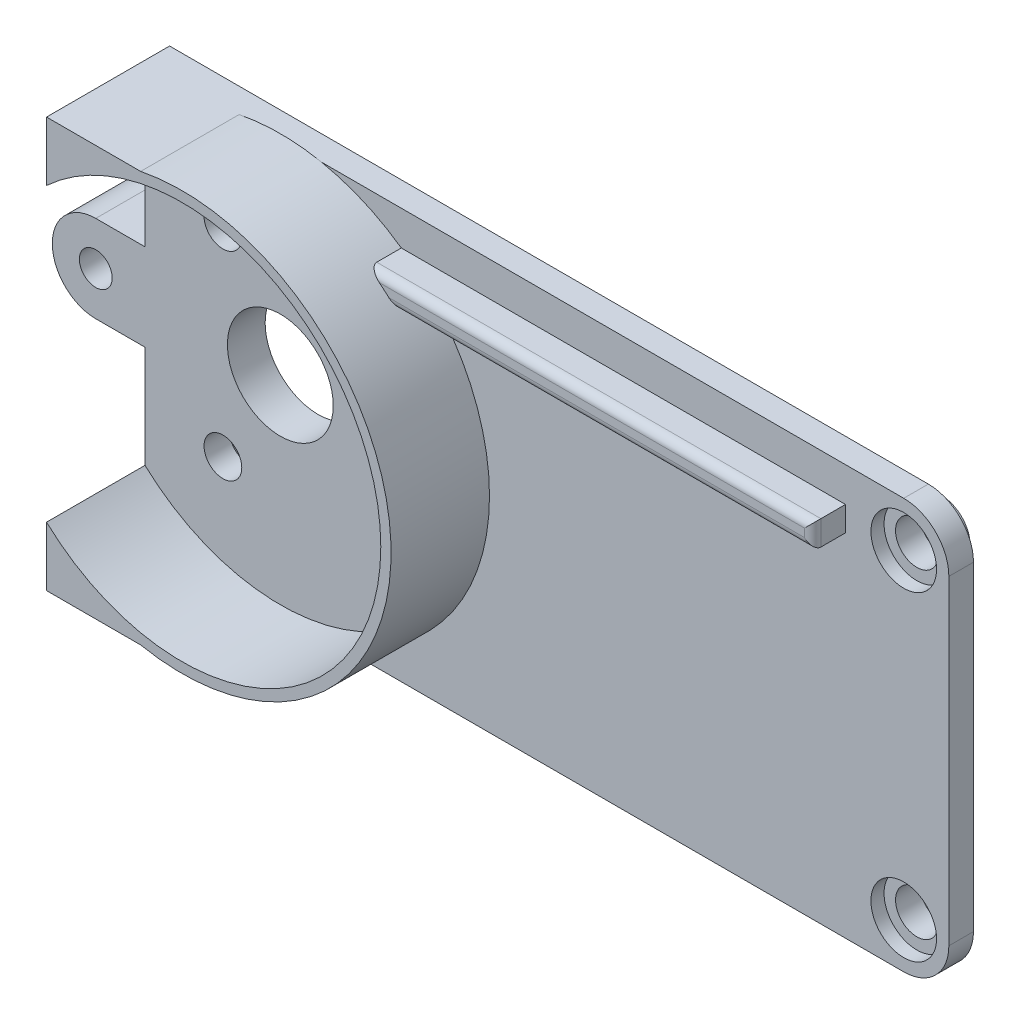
ISO-10303-21;
HEADER;
FILE_DESCRIPTION(('STEP AP214'),'2;1');
FILE_NAME('part.step','',(''),(''),'','','');
FILE_SCHEMA(('AUTOMOTIVE_DESIGN { 1 0 10303 214 1 1 1 1 }'));
ENDSEC;
DATA;
#1=APPLICATION_CONTEXT('core data for automotive mechanical design processes');
#2=APPLICATION_PROTOCOL_DEFINITION('international standard','automotive_design',2000,#1);
#3=PRODUCT_CONTEXT('',#1,'mechanical');
#4=PRODUCT('Part','Part','',(#3));
#5=PRODUCT_RELATED_PRODUCT_CATEGORY('part','',(#4));
#6=PRODUCT_DEFINITION_FORMATION('','',#4);
#7=PRODUCT_DEFINITION_CONTEXT('part definition',#1,'design');
#8=PRODUCT_DEFINITION('design','',#6,#7);
#9=PRODUCT_DEFINITION_SHAPE('','',#8);
#10=(LENGTH_UNIT() NAMED_UNIT(*) SI_UNIT(.MILLI.,.METRE.));
#11=(NAMED_UNIT(*) PLANE_ANGLE_UNIT() SI_UNIT($,.RADIAN.));
#12=(NAMED_UNIT(*) SI_UNIT($,.STERADIAN.) SOLID_ANGLE_UNIT());
#13=UNCERTAINTY_MEASURE_WITH_UNIT(LENGTH_MEASURE(1.E-05),#10,'distance_accuracy_value','');
#14=(GEOMETRIC_REPRESENTATION_CONTEXT(3) GLOBAL_UNCERTAINTY_ASSIGNED_CONTEXT((#13)) GLOBAL_UNIT_ASSIGNED_CONTEXT((#10,
#11,#12)) REPRESENTATION_CONTEXT('',''));
#15=CARTESIAN_POINT('',(0.,0.,0.));
#16=DIRECTION('',(0.,0.,1.));
#17=DIRECTION('',(1.,0.,0.));
#18=AXIS2_PLACEMENT_3D('',#15,#16,#17);
#19=CARTESIAN_POINT('',(46.25,2.75,-3.7));
#20=DIRECTION('',(0.,0.,1.));
#21=DIRECTION('',(1.,0.,0.));
#22=AXIS2_PLACEMENT_3D('',#19,#20,#21);
#23=CYLINDRICAL_SURFACE('',#22,1.3);
#24=CARTESIAN_POINT('',(46.25,2.75,0.));
#25=DIRECTION('',(0.,0.,-1.));
#26=DIRECTION('',(-1.,0.,0.));
#27=AXIS2_PLACEMENT_3D('',#24,#25,#26);
#28=CIRCLE('',#27,1.3);
#29=CARTESIAN_POINT('',(44.95,2.75,0.));
#30=VERTEX_POINT('',#29);
#31=EDGE_CURVE('E380',#30,#30,#28,.T.);
#32=ORIENTED_EDGE('',*,*,#31,.T.);
#33=EDGE_LOOP('',(#32));
#34=FACE_BOUND('',#33,.T.);
#35=CARTESIAN_POINT('',(46.25,2.75,1.5));
#36=DIRECTION('',(0.,0.,1.));
#37=DIRECTION('',(1.,0.,0.));
#38=AXIS2_PLACEMENT_3D('',#35,#36,#37);
#39=CIRCLE('',#38,1.3);
#40=CARTESIAN_POINT('',(47.55,2.75,1.5));
#41=VERTEX_POINT('',#40);
#42=EDGE_CURVE('E40',#41,#41,#39,.F.);
#43=ORIENTED_EDGE('',*,*,#42,.F.);
#44=EDGE_LOOP('',(#43));
#45=FACE_BOUND('',#44,.T.);
#46=ADVANCED_FACE('F36',(#34,#45),#23,.F.);
#47=CARTESIAN_POINT('',(46.25,22.25,-3.7));
#48=DIRECTION('',(0.,0.,1.));
#49=DIRECTION('',(1.,0.,0.));
#50=AXIS2_PLACEMENT_3D('',#47,#48,#49);
#51=CYLINDRICAL_SURFACE('',#50,1.3);
#52=CARTESIAN_POINT('',(46.25,22.25,0.));
#53=DIRECTION('',(0.,0.,-1.));
#54=DIRECTION('',(-1.,0.,0.));
#55=AXIS2_PLACEMENT_3D('',#52,#53,#54);
#56=CIRCLE('',#55,1.3);
#57=CARTESIAN_POINT('',(44.95,22.25,0.));
#58=VERTEX_POINT('',#57);
#59=EDGE_CURVE('E385',#58,#58,#56,.T.);
#60=ORIENTED_EDGE('',*,*,#59,.T.);
#61=EDGE_LOOP('',(#60));
#62=FACE_BOUND('',#61,.T.);
#63=CARTESIAN_POINT('',(46.25,22.25,1.5));
#64=DIRECTION('',(0.,0.,1.));
#65=DIRECTION('',(1.,0.,0.));
#66=AXIS2_PLACEMENT_3D('',#63,#64,#65);
#67=CIRCLE('',#66,1.3);
#68=CARTESIAN_POINT('',(47.55,22.25,1.5));
#69=VERTEX_POINT('',#68);
#70=EDGE_CURVE('E596',#69,#69,#67,.F.);
#71=ORIENTED_EDGE('',*,*,#70,.F.);
#72=EDGE_LOOP('',(#71));
#73=FACE_BOUND('',#72,.T.);
#74=ADVANCED_FACE('F496',(#62,#73),#51,.F.);
#75=CARTESIAN_POINT('',(0.,0.,2.3));
#76=DIRECTION('',(1.,0.,0.));
#77=DIRECTION('',(0.,0.,-1.));
#78=AXIS2_PLACEMENT_3D('',#75,#76,#77);
#79=PLANE('',#78);
#80=DIRECTION('',(0.,1.,0.));
#81=VECTOR('',#80,1.);
#82=CARTESIAN_POINT('',(0.,0.,0.8));
#83=LINE('',#82,#81);
#84=CARTESIAN_POINT('',(0.,15.15,0.8));
#85=VERTEX_POINT('',#84);
#86=CARTESIAN_POINT('',(0.,25.,0.8));
#87=VERTEX_POINT('',#86);
#88=EDGE_CURVE('E321',#85,#87,#83,.T.);
#89=ORIENTED_EDGE('',*,*,#88,.F.);
#90=DIRECTION('',(0.,0.,1.));
#91=VECTOR('',#90,1.);
#92=CARTESIAN_POINT('',(0.,15.15,-3.5));
#93=LINE('',#92,#91);
#94=CARTESIAN_POINT('',(0.,15.15,2.3));
#95=VERTEX_POINT('',#94);
#96=EDGE_CURVE('E269',#85,#95,#93,.T.);
#97=ORIENTED_EDGE('',*,*,#96,.T.);
#98=DIRECTION('',(0.,-1.,0.));
#99=VECTOR('',#98,1.);
#100=CARTESIAN_POINT('',(0.,0.,2.3));
#101=LINE('',#100,#99);
#102=CARTESIAN_POINT('',(0.,21.385557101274,2.3));
#103=VERTEX_POINT('',#102);
#104=EDGE_CURVE('E586',#103,#95,#101,.T.);
#105=ORIENTED_EDGE('',*,*,#104,.F.);
#106=DIRECTION('',(0.,0.,-1.));
#107=VECTOR('',#106,1.);
#108=CARTESIAN_POINT('',(0.,21.385557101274,8.3));
#109=LINE('',#108,#107);
#110=CARTESIAN_POINT('',(0.,21.385557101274,8.3));
#111=VERTEX_POINT('',#110);
#112=EDGE_CURVE('E550',#111,#103,#109,.T.);
#113=ORIENTED_EDGE('',*,*,#112,.F.);
#114=DIRECTION('',(0.,-1.,0.));
#115=VECTOR('',#114,1.);
#116=CARTESIAN_POINT('',(0.,25.,8.3));
#117=LINE('',#116,#115);
#118=CARTESIAN_POINT('',(0.,25.,8.3));
#119=VERTEX_POINT('',#118);
#120=EDGE_CURVE('E795',#119,#111,#117,.T.);
#121=ORIENTED_EDGE('',*,*,#120,.F.);
#122=DIRECTION('',(0.,0.,-1.));
#123=VECTOR('',#122,1.);
#124=CARTESIAN_POINT('',(0.,25.,2.3));
#125=LINE('',#124,#123);
#126=EDGE_CURVE('E580',#119,#87,#125,.T.);
#127=ORIENTED_EDGE('',*,*,#126,.T.);
#128=EDGE_LOOP('',(#89,#97,#105,#113,#121,#127));
#129=FACE_BOUND('',#128,.T.);
#130=ADVANCED_FACE('F500',(#129),#79,.F.);
#131=CARTESIAN_POINT('',(0.,25.,0.));
#132=DIRECTION('',(0.,0.,-1.));
#133=DIRECTION('',(-1.,0.,0.));
#134=AXIS2_PLACEMENT_3D('',#131,#132,#133);
#135=PLANE('',#134);
#136=CARTESIAN_POINT('',(15.25,12.5,0.));
#137=DIRECTION('',(0.,0.,-1.));
#138=DIRECTION('',(-1.,0.,0.));
#139=AXIS2_PLACEMENT_3D('',#136,#137,#138);
#140=CIRCLE('',#139,1.89999999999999);
#141=CARTESIAN_POINT('',(13.35,12.5,0.));
#142=VERTEX_POINT('',#141);
#143=EDGE_CURVE('E683',#142,#142,#140,.F.);
#144=ORIENTED_EDGE('',*,*,#143,.T.);
#145=EDGE_LOOP('',(#144));
#146=FACE_BOUND('',#145,.T.);
#147=CARTESIAN_POINT('',(4.75,18.5621778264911,0.));
#148=DIRECTION('',(0.,0.,-1.));
#149=DIRECTION('',(-1.,0.,0.));
#150=AXIS2_PLACEMENT_3D('',#147,#148,#149);
#151=CIRCLE('',#150,1.89999999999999);
#152=CARTESIAN_POINT('',(2.85000000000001,18.5621778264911,0.));
#153=VERTEX_POINT('',#152);
#154=EDGE_CURVE('E680',#153,#153,#151,.F.);
#155=ORIENTED_EDGE('',*,*,#154,.T.);
#156=EDGE_LOOP('',(#155));
#157=FACE_BOUND('',#156,.T.);
#158=CARTESIAN_POINT('',(4.75,6.43782217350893,0.));
#159=DIRECTION('',(0.,0.,-1.));
#160=DIRECTION('',(-1.,0.,0.));
#161=AXIS2_PLACEMENT_3D('',#158,#159,#160);
#162=CIRCLE('',#161,1.89999999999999);
#163=CARTESIAN_POINT('',(2.85000000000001,6.43782217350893,0.));
#164=VERTEX_POINT('',#163);
#165=EDGE_CURVE('E675',#164,#164,#162,.F.);
#166=ORIENTED_EDGE('',*,*,#165,.T.);
#167=EDGE_LOOP('',(#166));
#168=FACE_BOUND('',#167,.T.);
#169=CARTESIAN_POINT('',(36.45,12.5,0.));
#170=DIRECTION('',(0.,0.,-1.));
#171=DIRECTION('',(-1.,0.,0.));
#172=AXIS2_PLACEMENT_3D('',#169,#170,#171);
#173=CIRCLE('',#172,2.5);
#174=CARTESIAN_POINT('',(38.95,12.5,0.));
#175=VERTEX_POINT('',#174);
#176=EDGE_CURVE('E337',#175,#175,#173,.T.);
#177=ORIENTED_EDGE('',*,*,#176,.F.);
#178=EDGE_LOOP('',(#177));
#179=FACE_BOUND('',#178,.T.);
#180=CARTESIAN_POINT('',(22.35,12.5,0.));
#181=DIRECTION('',(0.,0.,-1.));
#182=DIRECTION('',(-1.,0.,0.));
#183=AXIS2_PLACEMENT_3D('',#180,#181,#182);
#184=CIRCLE('',#183,3.);
#185=CARTESIAN_POINT('',(19.35,12.5,0.));
#186=VERTEX_POINT('',#185);
#187=EDGE_CURVE('E349',#186,#186,#184,.T.);
#188=ORIENTED_EDGE('',*,*,#187,.F.);
#189=EDGE_LOOP('',(#188));
#190=FACE_BOUND('',#189,.T.);
#191=CARTESIAN_POINT('',(8.25,12.5,0.));
#192=DIRECTION('',(0.,0.,-1.));
#193=DIRECTION('',(-1.,0.,0.));
#194=AXIS2_PLACEMENT_3D('',#191,#192,#193);
#195=CIRCLE('',#194,3.225);
#196=CARTESIAN_POINT('',(5.025,12.5,0.));
#197=VERTEX_POINT('',#196);
#198=EDGE_CURVE('E394',#197,#197,#195,.T.);
#199=ORIENTED_EDGE('',*,*,#198,.F.);
#200=EDGE_LOOP('',(#199));
#201=FACE_BOUND('',#200,.T.);
#202=ORIENTED_EDGE('',*,*,#59,.F.);
#203=EDGE_LOOP('',(#202));
#204=FACE_BOUND('',#203,.T.);
#205=ORIENTED_EDGE('',*,*,#31,.F.);
#206=EDGE_LOOP('',(#205));
#207=FACE_BOUND('',#206,.T.);
#208=DIRECTION('',(-1.,0.,0.));
#209=VECTOR('',#208,1.);
#210=CARTESIAN_POINT('',(46.25,0.999999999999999,0.));
#211=LINE('',#210,#209);
#212=CARTESIAN_POINT('',(46.25,0.999999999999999,0.));
#213=VERTEX_POINT('',#212);
#214=CARTESIAN_POINT('',(1.,1.,0.));
#215=VERTEX_POINT('',#214);
#216=EDGE_CURVE('E284',#213,#215,#211,.T.);
#217=ORIENTED_EDGE('',*,*,#216,.T.);
#218=DIRECTION('',(0.,1.,0.));
#219=VECTOR('',#218,1.);
#220=CARTESIAN_POINT('',(1.,1.,0.));
#221=LINE('',#220,#219);
#222=CARTESIAN_POINT('',(1.,24.,0.));
#223=VERTEX_POINT('',#222);
#224=EDGE_CURVE('E267',#215,#223,#221,.T.);
#225=ORIENTED_EDGE('',*,*,#224,.T.);
#226=DIRECTION('',(1.,0.,0.));
#227=VECTOR('',#226,1.);
#228=CARTESIAN_POINT('',(1.,24.,0.));
#229=LINE('',#228,#227);
#230=CARTESIAN_POINT('',(46.25,24.,0.));
#231=VERTEX_POINT('',#230);
#232=EDGE_CURVE('E274',#223,#231,#229,.T.);
#233=ORIENTED_EDGE('',*,*,#232,.T.);
#234=CARTESIAN_POINT('',(46.25,22.25,0.));
#235=DIRECTION('',(0.,0.,-1.));
#236=DIRECTION('',(-1.,0.,0.));
#237=AXIS2_PLACEMENT_3D('',#234,#235,#236);
#238=CIRCLE('',#237,1.75);
#239=CARTESIAN_POINT('',(48.,22.25,0.));
#240=VERTEX_POINT('',#239);
#241=EDGE_CURVE('E61',#231,#240,#238,.T.);
#242=ORIENTED_EDGE('',*,*,#241,.T.);
#243=DIRECTION('',(0.,-1.,0.));
#244=VECTOR('',#243,1.);
#245=CARTESIAN_POINT('',(48.,22.25,0.));
#246=LINE('',#245,#244);
#247=CARTESIAN_POINT('',(48.,2.75,0.));
#248=VERTEX_POINT('',#247);
#249=EDGE_CURVE('E278',#240,#248,#246,.T.);
#250=ORIENTED_EDGE('',*,*,#249,.T.);
#251=CARTESIAN_POINT('',(46.25,2.75,0.));
#252=DIRECTION('',(0.,0.,-1.));
#253=DIRECTION('',(-1.,0.,0.));
#254=AXIS2_PLACEMENT_3D('',#251,#252,#253);
#255=CIRCLE('',#254,1.75);
#256=EDGE_CURVE('E281',#248,#213,#255,.T.);
#257=ORIENTED_EDGE('',*,*,#256,.T.);
#258=EDGE_LOOP('',(#217,#225,#233,#242,#250,#257));
#259=FACE_BOUND('',#258,.T.);
#260=ADVANCED_FACE('F769',(#146,#157,#168,#179,#190,#201,#204,#207,#259),#135,.T.);
#261=CARTESIAN_POINT('',(0.,9.85,2.3));
#262=VERTEX_POINT('',#261);
#263=CARTESIAN_POINT('',(0.,3.61444289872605,2.3));
#264=VERTEX_POINT('',#263);
#265=EDGE_CURVE('E555',#262,#264,#101,.T.);
#266=ORIENTED_EDGE('',*,*,#265,.F.);
#267=DIRECTION('',(0.,0.,1.));
#268=VECTOR('',#267,1.);
#269=CARTESIAN_POINT('',(0.,9.85,-3.5));
#270=LINE('',#269,#268);
#271=CARTESIAN_POINT('',(0.,9.85,0.8));
#272=VERTEX_POINT('',#271);
#273=EDGE_CURVE('E235',#272,#262,#270,.T.);
#274=ORIENTED_EDGE('',*,*,#273,.F.);
#275=CARTESIAN_POINT('',(0.,0.,0.8));
#276=VERTEX_POINT('',#275);
#277=EDGE_CURVE('E322',#276,#272,#83,.T.);
#278=ORIENTED_EDGE('',*,*,#277,.F.);
#279=DIRECTION('',(0.,0.,-1.));
#280=VECTOR('',#279,1.);
#281=CARTESIAN_POINT('',(0.,0.,2.3));
#282=LINE('',#281,#280);
#283=CARTESIAN_POINT('',(0.,0.,8.3));
#284=VERTEX_POINT('',#283);
#285=EDGE_CURVE('E583',#284,#276,#282,.T.);
#286=ORIENTED_EDGE('',*,*,#285,.F.);
#287=DIRECTION('',(0.,-1.,0.));
#288=VECTOR('',#287,1.);
#289=CARTESIAN_POINT('',(0.,0.,8.3));
#290=LINE('',#289,#288);
#291=CARTESIAN_POINT('',(0.,3.61444289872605,8.3));
#292=VERTEX_POINT('',#291);
#293=EDGE_CURVE('E557',#292,#284,#290,.T.);
#294=ORIENTED_EDGE('',*,*,#293,.F.);
#295=DIRECTION('',(0.,0.,-1.));
#296=VECTOR('',#295,1.);
#297=CARTESIAN_POINT('',(0.,3.61444289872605,8.3));
#298=LINE('',#297,#296);
#299=EDGE_CURVE('E547',#292,#264,#298,.T.);
#300=ORIENTED_EDGE('',*,*,#299,.T.);
#301=EDGE_LOOP('',(#266,#274,#278,#286,#294,#300));
#302=FACE_BOUND('',#301,.T.);
#303=ADVANCED_FACE('F38',(#302),#79,.F.);
#304=CARTESIAN_POINT('',(0.,0.,2.3));
#305=DIRECTION('',(0.,1.,0.));
#306=DIRECTION('',(0.,0.,1.));
#307=AXIS2_PLACEMENT_3D('',#304,#305,#306);
#308=PLANE('',#307);
#309=DIRECTION('',(-1.,0.,0.));
#310=VECTOR('',#309,1.);
#311=CARTESIAN_POINT('',(0.,0.,0.8));
#312=LINE('',#311,#310);
#313=CARTESIAN_POINT('',(46.25,0.,0.8));
#314=VERTEX_POINT('',#313);
#315=EDGE_CURVE('E319',#314,#276,#312,.T.);
#316=ORIENTED_EDGE('',*,*,#315,.F.);
#317=DIRECTION('',(0.,0.,-1.));
#318=VECTOR('',#317,1.);
#319=CARTESIAN_POINT('',(46.25,0.,2.3));
#320=LINE('',#319,#318);
#321=CARTESIAN_POINT('',(46.25,0.,2.3));
#322=VERTEX_POINT('',#321);
#323=EDGE_CURVE('E427',#314,#322,#320,.F.);
#324=ORIENTED_EDGE('',*,*,#323,.T.);
#325=DIRECTION('',(1.,0.,0.));
#326=VECTOR('',#325,1.);
#327=CARTESIAN_POINT('',(0.,0.,2.3));
#328=LINE('',#327,#326);
#329=CARTESIAN_POINT('',(10.7624689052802,0.,2.3));
#330=VERTEX_POINT('',#329);
#331=EDGE_CURVE('E573',#330,#322,#328,.T.);
#332=ORIENTED_EDGE('',*,*,#331,.F.);
#333=CARTESIAN_POINT('',(5.7375310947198,0.,2.3));
#334=VERTEX_POINT('',#333);
#335=EDGE_CURVE('E588',#334,#330,#328,.T.);
#336=ORIENTED_EDGE('',*,*,#335,.F.);
#337=DIRECTION('',(0.,0.,-1.));
#338=VECTOR('',#337,1.);
#339=CARTESIAN_POINT('',(5.7375310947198,0.,8.3));
#340=LINE('',#339,#338);
#341=CARTESIAN_POINT('',(5.7375310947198,0.,8.3));
#342=VERTEX_POINT('',#341);
#343=EDGE_CURVE('E558',#342,#334,#340,.T.);
#344=ORIENTED_EDGE('',*,*,#343,.F.);
#345=DIRECTION('',(1.,0.,0.));
#346=VECTOR('',#345,1.);
#347=CARTESIAN_POINT('',(0.,0.,8.3));
#348=LINE('',#347,#346);
#349=EDGE_CURVE('E563',#284,#342,#348,.T.);
#350=ORIENTED_EDGE('',*,*,#349,.F.);
#351=ORIENTED_EDGE('',*,*,#285,.T.);
#352=EDGE_LOOP('',(#316,#324,#332,#336,#344,#350,#351));
#353=FACE_BOUND('',#352,.T.);
#354=ADVANCED_FACE('F805',(#353),#308,.F.);
#355=CARTESIAN_POINT('',(49.,0.,2.3));
#356=DIRECTION('',(-1.,0.,0.));
#357=DIRECTION('',(0.,0.,1.));
#358=AXIS2_PLACEMENT_3D('',#355,#356,#357);
#359=PLANE('',#358);
#360=DIRECTION('',(0.,-1.,0.));
#361=VECTOR('',#360,1.);
#362=CARTESIAN_POINT('',(49.,0.,0.8));
#363=LINE('',#362,#361);
#364=CARTESIAN_POINT('',(49.,22.25,0.8));
#365=VERTEX_POINT('',#364);
#366=CARTESIAN_POINT('',(49.,2.75,0.8));
#367=VERTEX_POINT('',#366);
#368=EDGE_CURVE('E308',#365,#367,#363,.T.);
#369=ORIENTED_EDGE('',*,*,#368,.F.);
#370=DIRECTION('',(0.,0.,-1.));
#371=VECTOR('',#370,1.);
#372=CARTESIAN_POINT('',(49.,22.25,2.3));
#373=LINE('',#372,#371);
#374=CARTESIAN_POINT('',(49.,22.25,2.3));
#375=VERTEX_POINT('',#374);
#376=EDGE_CURVE('E421',#365,#375,#373,.F.);
#377=ORIENTED_EDGE('',*,*,#376,.T.);
#378=DIRECTION('',(0.,1.,0.));
#379=VECTOR('',#378,1.);
#380=CARTESIAN_POINT('',(49.,0.,2.3));
#381=LINE('',#380,#379);
#382=CARTESIAN_POINT('',(49.,2.75,2.3));
#383=VERTEX_POINT('',#382);
#384=EDGE_CURVE('E572',#383,#375,#381,.T.);
#385=ORIENTED_EDGE('',*,*,#384,.F.);
#386=DIRECTION('',(0.,0.,-1.));
#387=VECTOR('',#386,1.);
#388=CARTESIAN_POINT('',(49.,2.75,2.3));
#389=LINE('',#388,#387);
#390=EDGE_CURVE('E418',#383,#367,#389,.T.);
#391=ORIENTED_EDGE('',*,*,#390,.T.);
#392=EDGE_LOOP('',(#369,#377,#385,#391));
#393=FACE_BOUND('',#392,.T.);
#394=ADVANCED_FACE('F654',(#393),#359,.F.);
#395=CARTESIAN_POINT('',(0.,25.,2.3));
#396=DIRECTION('',(0.,-1.,0.));
#397=DIRECTION('',(0.,0.,-1.));
#398=AXIS2_PLACEMENT_3D('',#395,#396,#397);
#399=PLANE('',#398);
#400=DIRECTION('',(1.,0.,0.));
#401=VECTOR('',#400,1.);
#402=CARTESIAN_POINT('',(0.,25.,0.8));
#403=LINE('',#402,#401);
#404=CARTESIAN_POINT('',(46.25,25.,0.8));
#405=VERTEX_POINT('',#404);
#406=EDGE_CURVE('E329',#87,#405,#403,.T.);
#407=ORIENTED_EDGE('',*,*,#406,.F.);
#408=ORIENTED_EDGE('',*,*,#126,.F.);
#409=DIRECTION('',(-1.,0.,0.));
#410=VECTOR('',#409,1.);
#411=CARTESIAN_POINT('',(0.,25.,8.3));
#412=LINE('',#411,#410);
#413=CARTESIAN_POINT('',(5.73753109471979,25.,8.3));
#414=VERTEX_POINT('',#413);
#415=EDGE_CURVE('E797',#414,#119,#412,.T.);
#416=ORIENTED_EDGE('',*,*,#415,.F.);
#417=DIRECTION('',(0.,0.,-1.));
#418=VECTOR('',#417,1.);
#419=CARTESIAN_POINT('',(5.73753109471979,25.,8.3));
#420=LINE('',#419,#418);
#421=CARTESIAN_POINT('',(5.7375310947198,25.,2.3));
#422=VERTEX_POINT('',#421);
#423=EDGE_CURVE('E560',#414,#422,#420,.T.);
#424=ORIENTED_EDGE('',*,*,#423,.T.);
#425=DIRECTION('',(-1.,0.,0.));
#426=VECTOR('',#425,1.);
#427=CARTESIAN_POINT('',(0.,25.,2.3));
#428=LINE('',#427,#426);
#429=CARTESIAN_POINT('',(10.7624689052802,25.,2.3));
#430=VERTEX_POINT('',#429);
#431=EDGE_CURVE('E568',#430,#422,#428,.T.);
#432=ORIENTED_EDGE('',*,*,#431,.F.);
#433=CARTESIAN_POINT('',(46.25,25.,2.3));
#434=VERTEX_POINT('',#433);
#435=EDGE_CURVE('E571',#434,#430,#428,.T.);
#436=ORIENTED_EDGE('',*,*,#435,.F.);
#437=DIRECTION('',(0.,0.,-1.));
#438=VECTOR('',#437,1.);
#439=CARTESIAN_POINT('',(46.25,25.,2.3));
#440=LINE('',#439,#438);
#441=EDGE_CURVE('E399',#434,#405,#440,.T.);
#442=ORIENTED_EDGE('',*,*,#441,.T.);
#443=EDGE_LOOP('',(#407,#408,#416,#424,#432,#436,#442));
#444=FACE_BOUND('',#443,.T.);
#445=ADVANCED_FACE('F526',(#444),#399,.F.);
#446=CARTESIAN_POINT('',(46.25,22.25,2.3));
#447=DIRECTION('',(0.,0.,-1.));
#448=DIRECTION('',(-1.,0.,0.));
#449=AXIS2_PLACEMENT_3D('',#446,#447,#448);
#450=CYLINDRICAL_SURFACE('',#449,2.75);
#451=ORIENTED_EDGE('',*,*,#376,.F.);
#452=CARTESIAN_POINT('',(46.25,22.25,0.8));
#453=DIRECTION('',(0.,0.,-1.));
#454=DIRECTION('',(-1.,0.,0.));
#455=AXIS2_PLACEMENT_3D('',#452,#453,#454);
#456=CIRCLE('',#455,2.75);
#457=EDGE_CURVE('E325',#365,#405,#456,.F.);
#458=ORIENTED_EDGE('',*,*,#457,.T.);
#459=ORIENTED_EDGE('',*,*,#441,.F.);
#460=CARTESIAN_POINT('',(46.25,22.25,2.3));
#461=DIRECTION('',(0.,0.,-1.));
#462=DIRECTION('',(-1.,0.,0.));
#463=AXIS2_PLACEMENT_3D('',#460,#461,#462);
#464=CIRCLE('',#463,2.75);
#465=EDGE_CURVE('E425',#375,#434,#464,.F.);
#466=ORIENTED_EDGE('',*,*,#465,.F.);
#467=EDGE_LOOP('',(#451,#458,#459,#466));
#468=FACE_BOUND('',#467,.T.);
#469=ADVANCED_FACE('F522',(#468),#450,.T.);
#470=CARTESIAN_POINT('',(46.25,2.75,2.3));
#471=DIRECTION('',(0.,0.,-1.));
#472=DIRECTION('',(-1.,0.,0.));
#473=AXIS2_PLACEMENT_3D('',#470,#471,#472);
#474=CYLINDRICAL_SURFACE('',#473,2.75);
#475=ORIENTED_EDGE('',*,*,#323,.F.);
#476=CARTESIAN_POINT('',(46.25,2.75,0.8));
#477=DIRECTION('',(0.,0.,-1.));
#478=DIRECTION('',(-1.,0.,0.));
#479=AXIS2_PLACEMENT_3D('',#476,#477,#478);
#480=CIRCLE('',#479,2.75);
#481=EDGE_CURVE('E651',#314,#367,#480,.F.);
#482=ORIENTED_EDGE('',*,*,#481,.T.);
#483=ORIENTED_EDGE('',*,*,#390,.F.);
#484=CARTESIAN_POINT('',(46.25,2.75,2.3));
#485=DIRECTION('',(0.,0.,-1.));
#486=DIRECTION('',(-1.,0.,0.));
#487=AXIS2_PLACEMENT_3D('',#484,#485,#486);
#488=CIRCLE('',#487,2.75);
#489=EDGE_CURVE('E423',#322,#383,#488,.F.);
#490=ORIENTED_EDGE('',*,*,#489,.F.);
#491=EDGE_LOOP('',(#475,#482,#483,#490));
#492=FACE_BOUND('',#491,.T.);
#493=ADVANCED_FACE('F518',(#492),#474,.T.);
#494=CARTESIAN_POINT('',(0.,25.,2.3));
#495=DIRECTION('',(0.,0.,-1.));
#496=DIRECTION('',(-1.,0.,0.));
#497=AXIS2_PLACEMENT_3D('',#494,#495,#496);
#498=PLANE('',#497);
#499=CARTESIAN_POINT('',(46.25,2.75,2.3));
#500=DIRECTION('',(0.,0.,1.));
#501=DIRECTION('',(1.,0.,0.));
#502=AXIS2_PLACEMENT_3D('',#499,#500,#501);
#503=CIRCLE('',#502,2.);
#504=CARTESIAN_POINT('',(48.25,2.75,2.3));
#505=VERTEX_POINT('',#504);
#506=EDGE_CURVE('E613',#505,#505,#503,.T.);
#507=ORIENTED_EDGE('',*,*,#506,.F.);
#508=EDGE_LOOP('',(#507));
#509=FACE_BOUND('',#508,.T.);
#510=CARTESIAN_POINT('',(46.25,22.25,2.3));
#511=DIRECTION('',(0.,0.,1.));
#512=DIRECTION('',(1.,0.,0.));
#513=AXIS2_PLACEMENT_3D('',#510,#511,#512);
#514=CIRCLE('',#513,2.);
#515=CARTESIAN_POINT('',(48.25,22.25,2.3));
#516=VERTEX_POINT('',#515);
#517=EDGE_CURVE('E603',#516,#516,#514,.T.);
#518=ORIENTED_EDGE('',*,*,#517,.F.);
#519=EDGE_LOOP('',(#518));
#520=FACE_BOUND('',#519,.T.);
#521=DIRECTION('',(-1.,0.,0.));
#522=VECTOR('',#521,1.);
#523=CARTESIAN_POINT('',(15.6258050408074,22.9,2.3));
#524=LINE('',#523,#522);
#525=CARTESIAN_POINT('',(42.7,22.9,2.3));
#526=VERTEX_POINT('',#525);
#527=CARTESIAN_POINT('',(15.6258050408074,22.9,2.3));
#528=VERTEX_POINT('',#527);
#529=EDGE_CURVE('E363',#526,#528,#524,.T.);
#530=ORIENTED_EDGE('',*,*,#529,.F.);
#531=DIRECTION('',(0.,1.,0.));
#532=VECTOR('',#531,1.);
#533=CARTESIAN_POINT('',(42.7,22.9,2.3));
#534=LINE('',#533,#532);
#535=CARTESIAN_POINT('',(42.7,21.4,2.3));
#536=VERTEX_POINT('',#535);
#537=EDGE_CURVE('E360',#536,#526,#534,.T.);
#538=ORIENTED_EDGE('',*,*,#537,.F.);
#539=DIRECTION('',(1.,0.,0.));
#540=VECTOR('',#539,1.);
#541=CARTESIAN_POINT('',(17.3797590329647,21.4,2.3));
#542=LINE('',#541,#540);
#543=CARTESIAN_POINT('',(17.3797590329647,21.4,2.3));
#544=VERTEX_POINT('',#543);
#545=EDGE_CURVE('E366',#544,#536,#542,.T.);
#546=ORIENTED_EDGE('',*,*,#545,.F.);
#547=CARTESIAN_POINT('',(8.25,12.5,2.3));
#548=DIRECTION('',(0.,0.,1.));
#549=DIRECTION('',(1.,0.,0.));
#550=AXIS2_PLACEMENT_3D('',#547,#548,#549);
#551=CIRCLE('',#550,12.75);
#552=EDGE_CURVE('E395',#330,#544,#551,.T.);
#553=ORIENTED_EDGE('',*,*,#552,.F.);
#554=ORIENTED_EDGE('',*,*,#331,.T.);
#555=ORIENTED_EDGE('',*,*,#489,.T.);
#556=ORIENTED_EDGE('',*,*,#384,.T.);
#557=ORIENTED_EDGE('',*,*,#465,.T.);
#558=ORIENTED_EDGE('',*,*,#435,.T.);
#559=EDGE_CURVE('E400',#528,#430,#551,.T.);
#560=ORIENTED_EDGE('',*,*,#559,.F.);
#561=EDGE_LOOP('',(#530,#538,#546,#553,#554,#555,#556,#557,#558,#560));
#562=FACE_BOUND('',#561,.T.);
#563=ADVANCED_FACE('F521',(#509,#520,#562),#498,.F.);
#564=CARTESIAN_POINT('',(8.25,12.5,8.3));
#565=DIRECTION('',(0.,0.,-1.));
#566=DIRECTION('',(-1.,0.,0.));
#567=AXIS2_PLACEMENT_3D('',#564,#565,#566);
#568=CYLINDRICAL_SURFACE('',#567,12.75);
#569=CARTESIAN_POINT('',(8.25,12.5,4.3));
#570=DIRECTION('',(0.,0.,-1.));
#571=DIRECTION('',(1.,0.,0.));
#572=AXIS2_PLACEMENT_3D('',#569,#570,#571);
#573=CIRCLE('',#572,12.75);
#574=CARTESIAN_POINT('',(16.2844570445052,22.4,4.3));
#575=VERTEX_POINT('',#574);
#576=CARTESIAN_POINT('',(16.8640872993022,21.9,4.3));
#577=VERTEX_POINT('',#576);
#578=EDGE_CURVE('E369',#575,#577,#573,.T.);
#579=ORIENTED_EDGE('',*,*,#578,.F.);
#580=CARTESIAN_POINT('',(16.2844570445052,22.4,4.3));
#581=CARTESIAN_POINT('',(16.2571090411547,22.42219642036,4.29998614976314));
#582=CARTESIAN_POINT('',(16.2296667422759,22.4442777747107,4.29852140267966));
#583=CARTESIAN_POINT('',(16.1747421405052,22.4881023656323,4.29267762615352));
#584=CARTESIAN_POINT('',(16.1472598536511,22.509844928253,4.28829339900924));
#585=CARTESIAN_POINT('',(16.0922042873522,22.5530379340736,4.27653437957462));
#586=CARTESIAN_POINT('',(16.064633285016,22.5744826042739,4.26912748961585));
#587=CARTESIAN_POINT('',(16.0099789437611,22.6166405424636,4.25121086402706));
#588=CARTESIAN_POINT('',(15.9828951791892,22.6373544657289,4.24070399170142));
#589=CARTESIAN_POINT('',(15.9263759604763,22.6802334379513,4.21493069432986));
#590=CARTESIAN_POINT('',(15.8970386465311,22.7022825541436,4.199249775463));
#591=CARTESIAN_POINT('',(15.8401120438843,22.7447035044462,4.16325205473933));
#592=CARTESIAN_POINT('',(15.8125180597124,22.7650798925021,4.14294844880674));
#593=CARTESIAN_POINT('',(15.7677171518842,22.7979108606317,4.10351801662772));
#594=CARTESIAN_POINT('',(15.7497949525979,22.8109655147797,4.08571218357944));
#595=CARTESIAN_POINT('',(15.7161892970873,22.8353250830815,4.04700934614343));
#596=CARTESIAN_POINT('',(15.7005029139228,22.8466322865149,4.02611645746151));
#597=CARTESIAN_POINT('',(15.6766992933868,22.8637245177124,3.98777352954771));
#598=CARTESIAN_POINT('',(15.6677190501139,22.8701513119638,3.97115079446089));
#599=CARTESIAN_POINT('',(15.6519978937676,22.8813785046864,3.93640573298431));
#600=CARTESIAN_POINT('',(15.645249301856,22.8861844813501,3.91828882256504));
#601=CARTESIAN_POINT('',(15.6353637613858,22.8932158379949,3.88366184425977));
#602=CARTESIAN_POINT('',(15.6318351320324,22.8957214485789,3.86732271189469));
#603=CARTESIAN_POINT('',(15.6270296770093,22.899131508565,3.83400705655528));
#604=CARTESIAN_POINT('',(15.6257735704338,22.9000212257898,3.81702609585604));
#605=CARTESIAN_POINT('',(15.6258050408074,22.9,3.8));
#606=B_SPLINE_CURVE_WITH_KNOTS('',3,(#580,#581,#582,#583,#584,#585,#586,#587,#588,#589,#590,
#591,#592,#593,#594,#595,#596,#597,#598,#599,#600,#601,#602,#603,#604,#605),.UNSPECIFIED.,.F.,
.F.,(4,2,2,2,2,2,2,2,2,2,2,2,4),(0.,0.105637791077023,0.211464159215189,0.318444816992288,
0.42532696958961,0.544782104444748,0.663900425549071,0.748987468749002,0.833962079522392,
0.893634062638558,0.953098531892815,1.00357640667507,1.05451222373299),.UNSPECIFIED.);
#607=CARTESIAN_POINT('',(15.6258050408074,22.9,3.8));
#608=VERTEX_POINT('',#607);
#609=EDGE_CURVE('E448',#575,#608,#606,.T.);
#610=ORIENTED_EDGE('',*,*,#609,.T.);
#611=DIRECTION('',(0.,0.,-1.));
#612=VECTOR('',#611,1.);
#613=CARTESIAN_POINT('',(15.6258050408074,22.9,4.3));
#614=LINE('',#613,#612);
#615=EDGE_CURVE('E376',#608,#528,#614,.T.);
#616=ORIENTED_EDGE('',*,*,#615,.T.);
#617=ORIENTED_EDGE('',*,*,#559,.T.);
#618=EDGE_CURVE('E405',#430,#422,#551,.T.);
#619=ORIENTED_EDGE('',*,*,#618,.T.);
#620=ORIENTED_EDGE('',*,*,#423,.F.);
#621=CARTESIAN_POINT('',(8.25,12.5,8.3));
#622=DIRECTION('',(0.,0.,1.));
#623=DIRECTION('',(1.,0.,0.));
#624=AXIS2_PLACEMENT_3D('',#621,#622,#623);
#625=CIRCLE('',#624,12.75);
#626=EDGE_CURVE('E552',#342,#414,#625,.T.);
#627=ORIENTED_EDGE('',*,*,#626,.F.);
#628=ORIENTED_EDGE('',*,*,#343,.T.);
#629=EDGE_CURVE('E409',#334,#330,#551,.T.);
#630=ORIENTED_EDGE('',*,*,#629,.T.);
#631=ORIENTED_EDGE('',*,*,#552,.T.);
#632=DIRECTION('',(0.,0.,-1.));
#633=VECTOR('',#632,1.);
#634=CARTESIAN_POINT('',(17.3797590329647,21.4,4.3));
#635=LINE('',#634,#633);
#636=CARTESIAN_POINT('',(17.3797590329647,21.4,3.8));
#637=VERTEX_POINT('',#636);
#638=EDGE_CURVE('E374',#637,#544,#635,.T.);
#639=ORIENTED_EDGE('',*,*,#638,.F.);
#640=CARTESIAN_POINT('',(17.3797590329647,21.4,3.8));
#641=CARTESIAN_POINT('',(17.3797932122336,21.3999623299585,3.82250134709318));
#642=CARTESIAN_POINT('',(17.3782809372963,21.401516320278,3.8449508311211));
#643=CARTESIAN_POINT('',(17.3724590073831,21.4074839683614,3.88891392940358));
#644=CARTESIAN_POINT('',(17.3681721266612,21.4118743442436,3.91043365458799));
#645=CARTESIAN_POINT('',(17.3571017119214,21.4231864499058,3.95203979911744));
#646=CARTESIAN_POINT('',(17.3503243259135,21.4301019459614,3.97212960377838));
#647=CARTESIAN_POINT('',(17.3346578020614,21.4460392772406,4.01060393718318));
#648=CARTESIAN_POINT('',(17.3257642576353,21.4550655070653,4.02898479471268));
#649=CARTESIAN_POINT('',(17.3025076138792,21.4785840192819,4.07051089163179));
#650=CARTESIAN_POINT('',(17.2873551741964,21.4938447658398,4.09277829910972));
#651=CARTESIAN_POINT('',(17.2546372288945,21.5266022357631,4.13355797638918));
#652=CARTESIAN_POINT('',(17.2370678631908,21.544102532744,4.15206411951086));
#653=CARTESIAN_POINT('',(17.1929656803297,21.5877477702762,4.19202588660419));
#654=CARTESIAN_POINT('',(17.1656146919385,21.614596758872,4.21180427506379));
#655=CARTESIAN_POINT('',(17.1087318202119,21.6698941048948,4.24507981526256));
#656=CARTESIAN_POINT('',(17.0791938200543,21.6983468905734,4.25855851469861));
#657=CARTESIAN_POINT('',(17.0189792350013,21.7557666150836,4.27971785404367));
#658=CARTESIAN_POINT('',(16.9883103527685,21.7847295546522,4.28743206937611));
#659=CARTESIAN_POINT('',(16.926487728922,21.8425302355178,4.29753546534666));
#660=CARTESIAN_POINT('',(16.8953405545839,21.8713668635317,4.29997053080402));
#661=CARTESIAN_POINT('',(16.8640872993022,21.9,4.3));
#662=B_SPLINE_CURVE_WITH_KNOTS('',3,(#640,#641,#642,#643,#644,#645,#646,#647,#648,#649,#650,
#651,#652,#653,#654,#655,#656,#657,#658,#659,#660,#661),.UNSPECIFIED.,.F.,.F.,(4,2,2,2,2,2,2,2,
2,2,4),(0.,0.0673175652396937,0.134089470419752,0.200697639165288,0.267445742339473,
0.35980359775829,0.452310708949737,0.580998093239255,0.710060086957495,0.838364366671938,
0.96554891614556),.UNSPECIFIED.);
#663=EDGE_CURVE('E455',#637,#577,#662,.T.);
#664=ORIENTED_EDGE('',*,*,#663,.T.);
#665=EDGE_LOOP('',(#579,#610,#616,#617,#619,#620,#627,#628,#630,#631,#639,#664));
#666=FACE_BOUND('',#665,.T.);
#667=ADVANCED_FACE('F461',(#666),#568,.T.);
#668=CARTESIAN_POINT('',(15.25,12.5,2.3));
#669=DIRECTION('',(0.,0.,1.));
#670=DIRECTION('',(1.,0.,0.));
#671=AXIS2_PLACEMENT_3D('',#668,#669,#670);
#672=CIRCLE('',#671,1.15);
#673=CARTESIAN_POINT('',(16.4,12.5,2.3));
#674=VERTEX_POINT('',#673);
#675=EDGE_CURVE('E381',#674,#674,#672,.T.);
#676=ORIENTED_EDGE('',*,*,#675,.F.);
#677=EDGE_LOOP('',(#676));
#678=FACE_BOUND('',#677,.T.);
#679=CARTESIAN_POINT('',(4.75,6.43782217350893,2.3));
#680=DIRECTION('',(0.,0.,1.));
#681=DIRECTION('',(1.,0.,0.));
#682=AXIS2_PLACEMENT_3D('',#679,#680,#681);
#683=CIRCLE('',#682,1.15);
#684=CARTESIAN_POINT('',(5.9,6.43782217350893,2.3));
#685=VERTEX_POINT('',#684);
#686=EDGE_CURVE('E384',#685,#685,#683,.T.);
#687=ORIENTED_EDGE('',*,*,#686,.F.);
#688=EDGE_LOOP('',(#687));
#689=FACE_BOUND('',#688,.T.);
#690=CARTESIAN_POINT('',(4.75,18.5621778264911,2.3));
#691=DIRECTION('',(0.,0.,1.));
#692=DIRECTION('',(1.,0.,0.));
#693=AXIS2_PLACEMENT_3D('',#690,#691,#692);
#694=CIRCLE('',#693,1.15);
#695=CARTESIAN_POINT('',(5.9,18.5621778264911,2.3));
#696=VERTEX_POINT('',#695);
#697=EDGE_CURVE('E388',#696,#696,#694,.T.);
#698=ORIENTED_EDGE('',*,*,#697,.F.);
#699=EDGE_LOOP('',(#698));
#700=FACE_BOUND('',#699,.T.);
#701=CARTESIAN_POINT('',(8.25,12.5,2.3));
#702=DIRECTION('',(0.,0.,1.));
#703=DIRECTION('',(1.,0.,0.));
#704=AXIS2_PLACEMENT_3D('',#701,#702,#703);
#705=CIRCLE('',#704,3.225);
#706=CARTESIAN_POINT('',(11.475,12.5,2.3));
#707=VERTEX_POINT('',#706);
#708=EDGE_CURVE('E391',#707,#707,#705,.T.);
#709=ORIENTED_EDGE('',*,*,#708,.F.);
#710=EDGE_LOOP('',(#709));
#711=FACE_BOUND('',#710,.T.);
#712=CARTESIAN_POINT('',(8.25,12.5,2.3));
#713=DIRECTION('',(0.,0.,-1.));
#714=DIRECTION('',(1.,0.,0.));
#715=AXIS2_PLACEMENT_3D('',#712,#713,#714);
#716=CIRCLE('',#715,12.125);
#717=EDGE_CURVE('E413',#103,#264,#716,.T.);
#718=ORIENTED_EDGE('',*,*,#717,.F.);
#719=ORIENTED_EDGE('',*,*,#104,.T.);
#720=DIRECTION('',(-1.,0.,0.));
#721=VECTOR('',#720,1.);
#722=CARTESIAN_POINT('',(-3.,15.15,2.3));
#723=LINE('',#722,#721);
#724=CARTESIAN_POINT('',(-3.,15.15,2.3));
#725=VERTEX_POINT('',#724);
#726=EDGE_CURVE('E245',#95,#725,#723,.T.);
#727=ORIENTED_EDGE('',*,*,#726,.T.);
#728=CARTESIAN_POINT('',(-3.,12.5,2.3));
#729=DIRECTION('',(0.,0.,1.));
#730=DIRECTION('',(1.,0.,0.));
#731=AXIS2_PLACEMENT_3D('',#728,#729,#730);
#732=CIRCLE('',#731,2.65);
#733=CARTESIAN_POINT('',(-3.,9.85,2.3));
#734=VERTEX_POINT('',#733);
#735=EDGE_CURVE('E228',#725,#734,#732,.T.);
#736=ORIENTED_EDGE('',*,*,#735,.T.);
#737=DIRECTION('',(1.,0.,0.));
#738=VECTOR('',#737,1.);
#739=CARTESIAN_POINT('',(0.,9.85,2.3));
#740=LINE('',#739,#738);
#741=EDGE_CURVE('E239',#734,#262,#740,.T.);
#742=ORIENTED_EDGE('',*,*,#741,.T.);
#743=ORIENTED_EDGE('',*,*,#265,.T.);
#744=EDGE_LOOP('',(#718,#719,#727,#736,#742,#743));
#745=FACE_BOUND('',#744,.T.);
#746=CARTESIAN_POINT('',(-3.,12.5,2.3));
#747=DIRECTION('',(0.,0.,1.));
#748=DIRECTION('',(1.,0.,0.));
#749=AXIS2_PLACEMENT_3D('',#746,#747,#748);
#750=CIRCLE('',#749,1.);
#751=CARTESIAN_POINT('',(-2.,12.5,2.3));
#752=VERTEX_POINT('',#751);
#753=EDGE_CURVE('E253',#752,#752,#750,.T.);
#754=ORIENTED_EDGE('',*,*,#753,.F.);
#755=EDGE_LOOP('',(#754));
#756=FACE_BOUND('',#755,.T.);
#757=ADVANCED_FACE('F247',(#678,#689,#700,#711,#745,#756),#498,.F.);
#758=CARTESIAN_POINT('',(8.25,12.5,2.3));
#759=DIRECTION('',(0.,0.,1.));
#760=DIRECTION('',(1.,0.,0.));
#761=AXIS2_PLACEMENT_3D('',#758,#759,#760);
#762=PLANE('',#761);
#763=ORIENTED_EDGE('',*,*,#629,.F.);
#764=ORIENTED_EDGE('',*,*,#335,.T.);
#765=EDGE_LOOP('',(#763,#764));
#766=FACE_BOUND('',#765,.T.);
#767=ADVANCED_FACE('F528',(#766),#762,.F.);
#768=ORIENTED_EDGE('',*,*,#618,.F.);
#769=ORIENTED_EDGE('',*,*,#431,.T.);
#770=EDGE_LOOP('',(#768,#769));
#771=FACE_BOUND('',#770,.T.);
#772=ADVANCED_FACE('F531',(#771),#762,.F.);
#773=CARTESIAN_POINT('',(8.25,12.5,8.3));
#774=DIRECTION('',(0.,0.,-1.));
#775=DIRECTION('',(-1.,0.,0.));
#776=AXIS2_PLACEMENT_3D('',#773,#774,#775);
#777=CYLINDRICAL_SURFACE('',#776,12.125);
#778=ORIENTED_EDGE('',*,*,#717,.T.);
#779=ORIENTED_EDGE('',*,*,#299,.F.);
#780=CARTESIAN_POINT('',(8.25,12.5,8.3));
#781=DIRECTION('',(0.,0.,-1.));
#782=DIRECTION('',(1.,0.,0.));
#783=AXIS2_PLACEMENT_3D('',#780,#781,#782);
#784=CIRCLE('',#783,12.125);
#785=EDGE_CURVE('E800',#111,#292,#784,.T.);
#786=ORIENTED_EDGE('',*,*,#785,.F.);
#787=ORIENTED_EDGE('',*,*,#112,.T.);
#788=EDGE_LOOP('',(#778,#779,#786,#787));
#789=FACE_BOUND('',#788,.T.);
#790=ADVANCED_FACE('F534',(#789),#777,.F.);
#791=CARTESIAN_POINT('',(8.25,12.5,8.3));
#792=DIRECTION('',(0.,0.,1.));
#793=DIRECTION('',(1.,0.,0.));
#794=AXIS2_PLACEMENT_3D('',#791,#792,#793);
#795=PLANE('',#794);
#796=ORIENTED_EDGE('',*,*,#626,.T.);
#797=ORIENTED_EDGE('',*,*,#415,.T.);
#798=ORIENTED_EDGE('',*,*,#120,.T.);
#799=ORIENTED_EDGE('',*,*,#785,.T.);
#800=ORIENTED_EDGE('',*,*,#293,.T.);
#801=ORIENTED_EDGE('',*,*,#349,.T.);
#802=EDGE_LOOP('',(#796,#797,#798,#799,#800,#801));
#803=FACE_BOUND('',#802,.T.);
#804=ADVANCED_FACE('F516',(#803),#795,.T.);
#805=CARTESIAN_POINT('',(8.25,12.5,-3.7));
#806=DIRECTION('',(0.,0.,1.));
#807=DIRECTION('',(1.,0.,0.));
#808=AXIS2_PLACEMENT_3D('',#805,#806,#807);
#809=CYLINDRICAL_SURFACE('',#808,3.225);
#810=ORIENTED_EDGE('',*,*,#198,.T.);
#811=EDGE_LOOP('',(#810));
#812=FACE_BOUND('',#811,.T.);
#813=ORIENTED_EDGE('',*,*,#708,.T.);
#814=EDGE_LOOP('',(#813));
#815=FACE_BOUND('',#814,.T.);
#816=ADVANCED_FACE('F512',(#812,#815),#809,.F.);
#817=CARTESIAN_POINT('',(4.75,18.5621778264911,-3.7));
#818=DIRECTION('',(0.,0.,1.));
#819=DIRECTION('',(1.,0.,0.));
#820=AXIS2_PLACEMENT_3D('',#817,#818,#819);
#821=CYLINDRICAL_SURFACE('',#820,1.15);
#822=CARTESIAN_POINT('',(4.75,18.5621778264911,0.749999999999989));
#823=DIRECTION('',(0.,0.,-1.));
#824=DIRECTION('',(-1.,0.,0.));
#825=AXIS2_PLACEMENT_3D('',#822,#823,#824);
#826=CIRCLE('',#825,1.15);
#827=CARTESIAN_POINT('',(3.6,18.5621778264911,0.749999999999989));
#828=VERTEX_POINT('',#827);
#829=EDGE_CURVE('E45',#828,#828,#826,.T.);
#830=ORIENTED_EDGE('',*,*,#829,.T.);
#831=EDGE_LOOP('',(#830));
#832=FACE_BOUND('',#831,.T.);
#833=ORIENTED_EDGE('',*,*,#697,.T.);
#834=EDGE_LOOP('',(#833));
#835=FACE_BOUND('',#834,.T.);
#836=ADVANCED_FACE('F508',(#832,#835),#821,.F.);
#837=CARTESIAN_POINT('',(4.75,6.43782217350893,-3.7));
#838=DIRECTION('',(0.,0.,1.));
#839=DIRECTION('',(1.,0.,0.));
#840=AXIS2_PLACEMENT_3D('',#837,#838,#839);
#841=CYLINDRICAL_SURFACE('',#840,1.15);
#842=CARTESIAN_POINT('',(4.75,6.43782217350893,0.749999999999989));
#843=DIRECTION('',(0.,0.,-1.));
#844=DIRECTION('',(-1.,0.,0.));
#845=AXIS2_PLACEMENT_3D('',#842,#843,#844);
#846=CIRCLE('',#845,1.15);
#847=CARTESIAN_POINT('',(3.6,6.43782217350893,0.749999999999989));
#848=VERTEX_POINT('',#847);
#849=EDGE_CURVE('E13',#848,#848,#846,.T.);
#850=ORIENTED_EDGE('',*,*,#849,.T.);
#851=EDGE_LOOP('',(#850));
#852=FACE_BOUND('',#851,.T.);
#853=ORIENTED_EDGE('',*,*,#686,.T.);
#854=EDGE_LOOP('',(#853));
#855=FACE_BOUND('',#854,.T.);
#856=ADVANCED_FACE('F504',(#852,#855),#841,.F.);
#857=CARTESIAN_POINT('',(15.25,12.5,-3.7));
#858=DIRECTION('',(0.,0.,1.));
#859=DIRECTION('',(1.,0.,0.));
#860=AXIS2_PLACEMENT_3D('',#857,#858,#859);
#861=CYLINDRICAL_SURFACE('',#860,1.15);
#862=CARTESIAN_POINT('',(15.25,12.5,0.749999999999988));
#863=DIRECTION('',(0.,0.,-1.));
#864=DIRECTION('',(-1.,0.,0.));
#865=AXIS2_PLACEMENT_3D('',#862,#863,#864);
#866=CIRCLE('',#865,1.15);
#867=CARTESIAN_POINT('',(14.1,12.5,0.749999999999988));
#868=VERTEX_POINT('',#867);
#869=EDGE_CURVE('E673',#868,#868,#866,.T.);
#870=ORIENTED_EDGE('',*,*,#869,.T.);
#871=EDGE_LOOP('',(#870));
#872=FACE_BOUND('',#871,.T.);
#873=ORIENTED_EDGE('',*,*,#675,.T.);
#874=EDGE_LOOP('',(#873));
#875=FACE_BOUND('',#874,.T.);
#876=ADVANCED_FACE('F492',(#872,#875),#861,.F.);
#877=CARTESIAN_POINT('',(42.7,22.9,4.3));
#878=DIRECTION('',(-1.,0.,0.));
#879=DIRECTION('',(0.,0.,1.));
#880=AXIS2_PLACEMENT_3D('',#877,#878,#879);
#881=PLANE('',#880);
#882=DIRECTION('',(0.,0.,-1.));
#883=VECTOR('',#882,1.);
#884=CARTESIAN_POINT('',(42.7,22.9,4.3));
#885=LINE('',#884,#883);
#886=CARTESIAN_POINT('',(42.7,22.9,3.8));
#887=VERTEX_POINT('',#886);
#888=EDGE_CURVE('E378',#887,#526,#885,.T.);
#889=ORIENTED_EDGE('',*,*,#888,.F.);
#890=DIRECTION('',(0.,1.,0.));
#891=VECTOR('',#890,1.);
#892=CARTESIAN_POINT('',(42.7,21.4,3.8));
#893=LINE('',#892,#891);
#894=CARTESIAN_POINT('',(42.7,21.4,3.8));
#895=VERTEX_POINT('',#894);
#896=EDGE_CURVE('E442',#887,#895,#893,.F.);
#897=ORIENTED_EDGE('',*,*,#896,.T.);
#898=DIRECTION('',(0.,0.,-1.));
#899=VECTOR('',#898,1.);
#900=CARTESIAN_POINT('',(42.7,21.4,4.3));
#901=LINE('',#900,#899);
#902=EDGE_CURVE('E372',#895,#536,#901,.T.);
#903=ORIENTED_EDGE('',*,*,#902,.T.);
#904=ORIENTED_EDGE('',*,*,#537,.T.);
#905=EDGE_LOOP('',(#889,#897,#903,#904));
#906=FACE_BOUND('',#905,.T.);
#907=ADVANCED_FACE('F488',(#906),#881,.F.);
#908=CARTESIAN_POINT('',(15.6258050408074,22.9,4.3));
#909=DIRECTION('',(0.,-1.,0.));
#910=DIRECTION('',(0.,0.,-1.));
#911=AXIS2_PLACEMENT_3D('',#908,#909,#910);
#912=PLANE('',#911);
#913=ORIENTED_EDGE('',*,*,#615,.F.);
#914=DIRECTION('',(-1.,0.,0.));
#915=VECTOR('',#914,1.);
#916=CARTESIAN_POINT('',(42.7,22.9,3.8));
#917=LINE('',#916,#915);
#918=EDGE_CURVE('E444',#608,#887,#917,.F.);
#919=ORIENTED_EDGE('',*,*,#918,.T.);
#920=ORIENTED_EDGE('',*,*,#888,.T.);
#921=ORIENTED_EDGE('',*,*,#529,.T.);
#922=EDGE_LOOP('',(#913,#919,#920,#921));
#923=FACE_BOUND('',#922,.T.);
#924=ADVANCED_FACE('F484',(#923),#912,.F.);
#925=CARTESIAN_POINT('',(17.3797590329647,21.4,4.3));
#926=DIRECTION('',(0.,1.,0.));
#927=DIRECTION('',(0.,0.,1.));
#928=AXIS2_PLACEMENT_3D('',#925,#926,#927);
#929=PLANE('',#928);
#930=ORIENTED_EDGE('',*,*,#902,.F.);
#931=DIRECTION('',(1.,0.,0.));
#932=VECTOR('',#931,1.);
#933=CARTESIAN_POINT('',(17.3797590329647,21.4,3.8));
#934=LINE('',#933,#932);
#935=EDGE_CURVE('E446',#895,#637,#934,.F.);
#936=ORIENTED_EDGE('',*,*,#935,.T.);
#937=ORIENTED_EDGE('',*,*,#638,.T.);
#938=ORIENTED_EDGE('',*,*,#545,.T.);
#939=EDGE_LOOP('',(#930,#936,#937,#938));
#940=FACE_BOUND('',#939,.T.);
#941=ADVANCED_FACE('F480',(#940),#929,.F.);
#942=CARTESIAN_POINT('',(8.25,12.5,4.3));
#943=DIRECTION('',(0.,0.,1.));
#944=DIRECTION('',(1.,0.,0.));
#945=AXIS2_PLACEMENT_3D('',#942,#943,#944);
#946=PLANE('',#945);
#947=DIRECTION('',(0.,1.,0.));
#948=VECTOR('',#947,1.);
#949=CARTESIAN_POINT('',(42.2,22.9,4.3));
#950=LINE('',#949,#948);
#951=CARTESIAN_POINT('',(42.2,21.9,4.3));
#952=VERTEX_POINT('',#951);
#953=CARTESIAN_POINT('',(42.2,22.4,4.3));
#954=VERTEX_POINT('',#953);
#955=EDGE_CURVE('E437',#952,#954,#950,.T.);
#956=ORIENTED_EDGE('',*,*,#955,.T.);
#957=DIRECTION('',(-1.,0.,0.));
#958=VECTOR('',#957,1.);
#959=CARTESIAN_POINT('',(15.6258050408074,22.4,4.3));
#960=LINE('',#959,#958);
#961=EDGE_CURVE('E440',#954,#575,#960,.T.);
#962=ORIENTED_EDGE('',*,*,#961,.T.);
#963=ORIENTED_EDGE('',*,*,#578,.T.);
#964=DIRECTION('',(1.,0.,0.));
#965=VECTOR('',#964,1.);
#966=CARTESIAN_POINT('',(42.7,21.9,4.3));
#967=LINE('',#966,#965);
#968=EDGE_CURVE('E429',#577,#952,#967,.T.);
#969=ORIENTED_EDGE('',*,*,#968,.T.);
#970=EDGE_LOOP('',(#956,#962,#963,#969));
#971=FACE_BOUND('',#970,.T.);
#972=ADVANCED_FACE('F476',(#971),#946,.T.);
#973=CARTESIAN_POINT('',(8.25,21.9,3.8));
#974=DIRECTION('',(-1.,0.,0.));
#975=DIRECTION('',(0.,0.,1.));
#976=AXIS2_PLACEMENT_3D('',#973,#974,#975);
#977=CYLINDRICAL_SURFACE('',#976,0.5);
#978=ORIENTED_EDGE('',*,*,#663,.F.);
#979=ORIENTED_EDGE('',*,*,#935,.F.);
#980=CARTESIAN_POINT('',(42.2,21.9,3.8));
#981=DIRECTION('',(-0.707106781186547,-0.707106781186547,0.));
#982=DIRECTION('',(-0.707106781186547,0.707106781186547,0.));
#983=AXIS2_PLACEMENT_3D('',#980,#981,#982);
#984=ELLIPSE('',#983,0.707106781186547,0.5);
#985=EDGE_CURVE('E357',#952,#895,#984,.F.);
#986=ORIENTED_EDGE('',*,*,#985,.F.);
#987=ORIENTED_EDGE('',*,*,#968,.F.);
#988=EDGE_LOOP('',(#978,#979,#986,#987));
#989=FACE_BOUND('',#988,.T.);
#990=ADVANCED_FACE('F470',(#989),#977,.T.);
#991=CARTESIAN_POINT('',(8.25,22.4,3.8));
#992=DIRECTION('',(1.,0.,0.));
#993=DIRECTION('',(0.,0.,-1.));
#994=AXIS2_PLACEMENT_3D('',#991,#992,#993);
#995=CYLINDRICAL_SURFACE('',#994,0.5);
#996=ORIENTED_EDGE('',*,*,#609,.F.);
#997=ORIENTED_EDGE('',*,*,#961,.F.);
#998=CARTESIAN_POINT('',(42.2,22.4,3.8));
#999=DIRECTION('',(0.707106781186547,-0.707106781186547,0.));
#1000=DIRECTION('',(0.707106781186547,0.707106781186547,0.));
#1001=AXIS2_PLACEMENT_3D('',#998,#999,#1000);
#1002=ELLIPSE('',#1001,0.707106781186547,0.5);
#1003=EDGE_CURVE('E355',#887,#954,#1002,.T.);
#1004=ORIENTED_EDGE('',*,*,#1003,.F.);
#1005=ORIENTED_EDGE('',*,*,#918,.F.);
#1006=EDGE_LOOP('',(#996,#997,#1004,#1005));
#1007=FACE_BOUND('',#1006,.T.);
#1008=ADVANCED_FACE('F465',(#1007),#995,.T.);
#1009=CARTESIAN_POINT('',(42.2,12.5,3.8));
#1010=DIRECTION('',(0.,-1.,0.));
#1011=DIRECTION('',(0.,0.,-1.));
#1012=AXIS2_PLACEMENT_3D('',#1009,#1010,#1011);
#1013=CYLINDRICAL_SURFACE('',#1012,0.5);
#1014=ORIENTED_EDGE('',*,*,#985,.T.);
#1015=ORIENTED_EDGE('',*,*,#896,.F.);
#1016=ORIENTED_EDGE('',*,*,#1003,.T.);
#1017=ORIENTED_EDGE('',*,*,#955,.F.);
#1018=EDGE_LOOP('',(#1014,#1015,#1016,#1017));
#1019=FACE_BOUND('',#1018,.T.);
#1020=ADVANCED_FACE('F469',(#1019),#1013,.T.);
#1021=CARTESIAN_POINT('',(22.35,12.5,-1.5));
#1022=DIRECTION('',(0.,0.,-1.));
#1023=DIRECTION('',(-1.,0.,0.));
#1024=AXIS2_PLACEMENT_3D('',#1021,#1022,#1023);
#1025=PLANE('',#1024);
#1026=CARTESIAN_POINT('',(22.35,12.5,-1.5));
#1027=DIRECTION('',(0.,0.,-1.));
#1028=DIRECTION('',(-1.,0.,0.));
#1029=AXIS2_PLACEMENT_3D('',#1026,#1027,#1028);
#1030=CIRCLE('',#1029,3.);
#1031=CARTESIAN_POINT('',(19.35,12.5,-1.5));
#1032=VERTEX_POINT('',#1031);
#1033=EDGE_CURVE('E352',#1032,#1032,#1030,.T.);
#1034=ORIENTED_EDGE('',*,*,#1033,.T.);
#1035=EDGE_LOOP('',(#1034));
#1036=FACE_BOUND('',#1035,.T.);
#1037=CARTESIAN_POINT('',(22.35,12.5,-1.5));
#1038=DIRECTION('',(0.,0.,-1.));
#1039=DIRECTION('',(-1.,0.,0.));
#1040=AXIS2_PLACEMENT_3D('',#1037,#1038,#1039);
#1041=CIRCLE('',#1040,1.525);
#1042=CARTESIAN_POINT('',(20.825,12.5,-1.5));
#1043=VERTEX_POINT('',#1042);
#1044=EDGE_CURVE('E346',#1043,#1043,#1041,.T.);
#1045=ORIENTED_EDGE('',*,*,#1044,.F.);
#1046=EDGE_LOOP('',(#1045));
#1047=FACE_BOUND('',#1046,.T.);
#1048=ADVANCED_FACE('F758',(#1036,#1047),#1025,.T.);
#1049=CARTESIAN_POINT('',(22.35,12.5,-1.5));
#1050=DIRECTION('',(0.,0.,1.));
#1051=DIRECTION('',(1.,0.,0.));
#1052=AXIS2_PLACEMENT_3D('',#1049,#1050,#1051);
#1053=CYLINDRICAL_SURFACE('',#1052,3.);
#1054=ORIENTED_EDGE('',*,*,#1033,.F.);
#1055=EDGE_LOOP('',(#1054));
#1056=FACE_BOUND('',#1055,.T.);
#1057=ORIENTED_EDGE('',*,*,#187,.T.);
#1058=EDGE_LOOP('',(#1057));
#1059=FACE_BOUND('',#1058,.T.);
#1060=ADVANCED_FACE('F756',(#1056,#1059),#1053,.T.);
#1061=CARTESIAN_POINT('',(22.35,12.5,-1.5));
#1062=DIRECTION('',(0.,0.,1.));
#1063=DIRECTION('',(1.,0.,0.));
#1064=AXIS2_PLACEMENT_3D('',#1061,#1062,#1063);
#1065=CYLINDRICAL_SURFACE('',#1064,1.525);
#1066=ORIENTED_EDGE('',*,*,#1044,.T.);
#1067=EDGE_LOOP('',(#1066));
#1068=FACE_BOUND('',#1067,.T.);
#1069=CARTESIAN_POINT('',(22.35,12.5,1.5));
#1070=DIRECTION('',(0.,0.,-1.));
#1071=DIRECTION('',(-1.,0.,0.));
#1072=AXIS2_PLACEMENT_3D('',#1069,#1070,#1071);
#1073=CIRCLE('',#1072,1.525);
#1074=CARTESIAN_POINT('',(20.825,12.5,1.5));
#1075=VERTEX_POINT('',#1074);
#1076=EDGE_CURVE('E343',#1075,#1075,#1073,.T.);
#1077=ORIENTED_EDGE('',*,*,#1076,.F.);
#1078=EDGE_LOOP('',(#1077));
#1079=FACE_BOUND('',#1078,.T.);
#1080=ADVANCED_FACE('F752',(#1068,#1079),#1065,.F.);
#1081=CARTESIAN_POINT('',(22.35,12.5,1.5));
#1082=DIRECTION('',(0.,0.,-1.));
#1083=DIRECTION('',(-1.,0.,0.));
#1084=AXIS2_PLACEMENT_3D('',#1081,#1082,#1083);
#1085=PLANE('',#1084);
#1086=ORIENTED_EDGE('',*,*,#1076,.T.);
#1087=EDGE_LOOP('',(#1086));
#1088=FACE_BOUND('',#1087,.T.);
#1089=ADVANCED_FACE('F745',(#1088),#1085,.T.);
#1090=CARTESIAN_POINT('',(36.45,12.5,-3.8));
#1091=DIRECTION('',(0.,0.,-1.));
#1092=DIRECTION('',(-1.,0.,0.));
#1093=AXIS2_PLACEMENT_3D('',#1090,#1091,#1092);
#1094=PLANE('',#1093);
#1095=CARTESIAN_POINT('',(36.45,12.5,-3.8));
#1096=DIRECTION('',(0.,0.,-1.));
#1097=DIRECTION('',(-1.,0.,0.));
#1098=AXIS2_PLACEMENT_3D('',#1095,#1096,#1097);
#1099=CIRCLE('',#1098,2.5);
#1100=CARTESIAN_POINT('',(38.95,12.5,-3.8));
#1101=VERTEX_POINT('',#1100);
#1102=EDGE_CURVE('E340',#1101,#1101,#1099,.T.);
#1103=ORIENTED_EDGE('',*,*,#1102,.T.);
#1104=EDGE_LOOP('',(#1103));
#1105=FACE_BOUND('',#1104,.T.);
#1106=CARTESIAN_POINT('',(36.45,12.5,-3.8));
#1107=DIRECTION('',(0.,0.,-1.));
#1108=DIRECTION('',(-1.,0.,0.));
#1109=AXIS2_PLACEMENT_3D('',#1106,#1107,#1108);
#1110=CIRCLE('',#1109,1.575);
#1111=CARTESIAN_POINT('',(38.025,12.5,-3.8));
#1112=VERTEX_POINT('',#1111);
#1113=EDGE_CURVE('E334',#1112,#1112,#1110,.T.);
#1114=ORIENTED_EDGE('',*,*,#1113,.F.);
#1115=EDGE_LOOP('',(#1114));
#1116=FACE_BOUND('',#1115,.T.);
#1117=ADVANCED_FACE('F742',(#1105,#1116),#1094,.T.);
#1118=CARTESIAN_POINT('',(36.45,12.5,-3.8));
#1119=DIRECTION('',(0.,0.,1.));
#1120=DIRECTION('',(1.,0.,0.));
#1121=AXIS2_PLACEMENT_3D('',#1118,#1119,#1120);
#1122=CYLINDRICAL_SURFACE('',#1121,2.5);
#1123=CARTESIAN_POINT('',(38.95,12.5,-3.8));
#1124=CARTESIAN_POINT('',(38.95,12.5,-3.76041666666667));
#1125=CARTESIAN_POINT('',(38.95,12.5,-3.72083333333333));
#1126=CARTESIAN_POINT('',(38.95,12.5,-3.64166666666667));
#1127=CARTESIAN_POINT('',(38.95,12.5,-3.60208333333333));
#1128=CARTESIAN_POINT('',(38.95,12.5,-3.52291666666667));
#1129=CARTESIAN_POINT('',(38.95,12.5,-3.48333333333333));
#1130=CARTESIAN_POINT('',(38.95,12.5,-3.40416666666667));
#1131=CARTESIAN_POINT('',(38.95,12.5,-3.36458333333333));
#1132=CARTESIAN_POINT('',(38.95,12.5,-3.28541666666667));
#1133=CARTESIAN_POINT('',(38.95,12.5,-3.24583333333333));
#1134=CARTESIAN_POINT('',(38.95,12.5,-3.16666666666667));
#1135=CARTESIAN_POINT('',(38.95,12.5,-3.12708333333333));
#1136=CARTESIAN_POINT('',(38.95,12.5,-3.04791666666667));
#1137=CARTESIAN_POINT('',(38.95,12.5,-3.00833333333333));
#1138=CARTESIAN_POINT('',(38.95,12.5,-2.92916666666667));
#1139=CARTESIAN_POINT('',(38.95,12.5,-2.88958333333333));
#1140=CARTESIAN_POINT('',(38.95,12.5,-2.81041666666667));
#1141=CARTESIAN_POINT('',(38.95,12.5,-2.77083333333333));
#1142=CARTESIAN_POINT('',(38.95,12.5,-2.69166666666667));
#1143=CARTESIAN_POINT('',(38.95,12.5,-2.65208333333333));
#1144=CARTESIAN_POINT('',(38.95,12.5,-2.57291666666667));
#1145=CARTESIAN_POINT('',(38.95,12.5,-2.53333333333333));
#1146=CARTESIAN_POINT('',(38.95,12.5,-2.45416666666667));
#1147=CARTESIAN_POINT('',(38.95,12.5,-2.41458333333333));
#1148=CARTESIAN_POINT('',(38.95,12.5,-2.33541666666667));
#1149=CARTESIAN_POINT('',(38.95,12.5,-2.29583333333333));
#1150=CARTESIAN_POINT('',(38.95,12.5,-2.21666666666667));
#1151=CARTESIAN_POINT('',(38.95,12.5,-2.17708333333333));
#1152=CARTESIAN_POINT('',(38.95,12.5,-2.09791666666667));
#1153=CARTESIAN_POINT('',(38.95,12.5,-2.05833333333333));
#1154=CARTESIAN_POINT('',(38.95,12.5,-1.97916666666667));
#1155=CARTESIAN_POINT('',(38.95,12.5,-1.93958333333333));
#1156=CARTESIAN_POINT('',(38.95,12.5,-1.86041666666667));
#1157=CARTESIAN_POINT('',(38.95,12.5,-1.82083333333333));
#1158=CARTESIAN_POINT('',(38.95,12.5,-1.74166666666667));
#1159=CARTESIAN_POINT('',(38.95,12.5,-1.70208333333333));
#1160=CARTESIAN_POINT('',(38.95,12.5,-1.62291666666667));
#1161=CARTESIAN_POINT('',(38.95,12.5,-1.58333333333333));
#1162=CARTESIAN_POINT('',(38.95,12.5,-1.50416666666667));
#1163=CARTESIAN_POINT('',(38.95,12.5,-1.46458333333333));
#1164=CARTESIAN_POINT('',(38.95,12.5,-1.38541666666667));
#1165=CARTESIAN_POINT('',(38.95,12.5,-1.34583333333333));
#1166=CARTESIAN_POINT('',(38.95,12.5,-1.26666666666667));
#1167=CARTESIAN_POINT('',(38.95,12.5,-1.22708333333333));
#1168=CARTESIAN_POINT('',(38.95,12.5,-1.14791666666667));
#1169=CARTESIAN_POINT('',(38.95,12.5,-1.10833333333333));
#1170=CARTESIAN_POINT('',(38.95,12.5,-1.02916666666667));
#1171=CARTESIAN_POINT('',(38.95,12.5,-0.989583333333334));
#1172=CARTESIAN_POINT('',(38.95,12.5,-0.910416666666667));
#1173=CARTESIAN_POINT('',(38.95,12.5,-0.870833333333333));
#1174=CARTESIAN_POINT('',(38.95,12.5,-0.791666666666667));
#1175=CARTESIAN_POINT('',(38.95,12.5,-0.752083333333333));
#1176=CARTESIAN_POINT('',(38.95,12.5,-0.672916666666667));
#1177=CARTESIAN_POINT('',(38.95,12.5,-0.633333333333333));
#1178=CARTESIAN_POINT('',(38.95,12.5,-0.554166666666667));
#1179=CARTESIAN_POINT('',(38.95,12.5,-0.514583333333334));
#1180=CARTESIAN_POINT('',(38.95,12.5,-0.435416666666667));
#1181=CARTESIAN_POINT('',(38.95,12.5,-0.395833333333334));
#1182=CARTESIAN_POINT('',(38.95,12.5,-0.316666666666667));
#1183=CARTESIAN_POINT('',(38.95,12.5,-0.277083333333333));
#1184=CARTESIAN_POINT('',(38.95,12.5,-0.197916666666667));
#1185=CARTESIAN_POINT('',(38.95,12.5,-0.158333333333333));
#1186=CARTESIAN_POINT('',(38.95,12.5,-0.0791666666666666));
#1187=CARTESIAN_POINT('',(38.95,12.5,-0.0395833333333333));
#1188=CARTESIAN_POINT('',(38.95,12.5,0.));
#1189=B_SPLINE_CURVE_WITH_KNOTS('',3,(#1123,#1124,#1125,#1126,#1127,#1128,#1129,#1130,#1131,
#1132,#1133,#1134,#1135,#1136,#1137,#1138,#1139,#1140,#1141,#1142,#1143,#1144,#1145,#1146,#1147,
#1148,#1149,#1150,#1151,#1152,#1153,#1154,#1155,#1156,#1157,#1158,#1159,#1160,#1161,#1162,#1163,
#1164,#1165,#1166,#1167,#1168,#1169,#1170,#1171,#1172,#1173,#1174,#1175,#1176,#1177,#1178,#1179,
#1180,#1181,#1182,#1183,#1184,#1185,#1186,#1187,#1188),.UNSPECIFIED.,.F.,.F.,(4,2,2,2,2,2,2,2,2,
2,2,2,2,2,2,2,2,2,2,2,2,2,2,2,2,2,2,2,2,2,2,2,4),(0.,0.11875,0.2375,0.35625,0.475,0.59375,
0.7125,0.83125,0.95,1.06875,1.1875,1.30625,1.425,1.54375,1.6625,1.78125,1.9,2.01875,2.1375,
2.25625,2.375,2.49375,2.6125,2.73125,2.85,2.96875,3.0875,3.20625,3.325,3.44375,3.5625,3.68125,
3.8),.UNSPECIFIED.);
#1190=EDGE_CURVE('BSEAM740',#1101,#175,#1189,.T.);
#1191=ORIENTED_EDGE('',*,*,#1102,.F.);
#1192=ORIENTED_EDGE('',*,*,#176,.T.);
#1193=ORIENTED_EDGE('',*,*,#1190,.T.);
#1194=ORIENTED_EDGE('',*,*,#1190,.F.);
#1195=EDGE_LOOP('',(#1191,#1193,#1192,#1194));
#1196=FACE_BOUND('',#1195,.T.);
#1197=ADVANCED_FACE('F740',(#1196),#1122,.T.);
#1198=CARTESIAN_POINT('',(36.45,12.5,-3.8));
#1199=DIRECTION('',(0.,0.,1.));
#1200=DIRECTION('',(1.,0.,0.));
#1201=AXIS2_PLACEMENT_3D('',#1198,#1199,#1200);
#1202=CYLINDRICAL_SURFACE('',#1201,1.575);
#1203=CARTESIAN_POINT('',(36.45,12.5,0.7));
#1204=DIRECTION('',(0.,0.,-1.));
#1205=DIRECTION('',(-1.,0.,0.));
#1206=AXIS2_PLACEMENT_3D('',#1203,#1204,#1205);
#1207=CIRCLE('',#1206,1.575);
#1208=CARTESIAN_POINT('',(38.025,12.5,0.7));
#1209=VERTEX_POINT('',#1208);
#1210=EDGE_CURVE('E331',#1209,#1209,#1207,.T.);
#1211=CARTESIAN_POINT('',(38.025,12.5,-3.8));
#1212=CARTESIAN_POINT('',(38.025,12.5,-3.753125));
#1213=CARTESIAN_POINT('',(38.025,12.5,-3.70625));
#1214=CARTESIAN_POINT('',(38.025,12.5,-3.6125));
#1215=CARTESIAN_POINT('',(38.025,12.5,-3.565625));
#1216=CARTESIAN_POINT('',(38.025,12.5,-3.471875));
#1217=CARTESIAN_POINT('',(38.025,12.5,-3.425));
#1218=CARTESIAN_POINT('',(38.025,12.5,-3.33125));
#1219=CARTESIAN_POINT('',(38.025,12.5,-3.284375));
#1220=CARTESIAN_POINT('',(38.025,12.5,-3.190625));
#1221=CARTESIAN_POINT('',(38.025,12.5,-3.14375));
#1222=CARTESIAN_POINT('',(38.025,12.5,-3.05));
#1223=CARTESIAN_POINT('',(38.025,12.5,-3.003125));
#1224=CARTESIAN_POINT('',(38.025,12.5,-2.909375));
#1225=CARTESIAN_POINT('',(38.025,12.5,-2.8625));
#1226=CARTESIAN_POINT('',(38.025,12.5,-2.76875));
#1227=CARTESIAN_POINT('',(38.025,12.5,-2.721875));
#1228=CARTESIAN_POINT('',(38.025,12.5,-2.628125));
#1229=CARTESIAN_POINT('',(38.025,12.5,-2.58125));
#1230=CARTESIAN_POINT('',(38.025,12.5,-2.4875));
#1231=CARTESIAN_POINT('',(38.025,12.5,-2.440625));
#1232=CARTESIAN_POINT('',(38.025,12.5,-2.346875));
#1233=CARTESIAN_POINT('',(38.025,12.5,-2.3));
#1234=CARTESIAN_POINT('',(38.025,12.5,-2.20625));
#1235=CARTESIAN_POINT('',(38.025,12.5,-2.159375));
#1236=CARTESIAN_POINT('',(38.025,12.5,-2.065625));
#1237=CARTESIAN_POINT('',(38.025,12.5,-2.01875));
#1238=CARTESIAN_POINT('',(38.025,12.5,-1.925));
#1239=CARTESIAN_POINT('',(38.025,12.5,-1.878125));
#1240=CARTESIAN_POINT('',(38.025,12.5,-1.784375));
#1241=CARTESIAN_POINT('',(38.025,12.5,-1.7375));
#1242=CARTESIAN_POINT('',(38.025,12.5,-1.64375));
#1243=CARTESIAN_POINT('',(38.025,12.5,-1.596875));
#1244=CARTESIAN_POINT('',(38.025,12.5,-1.503125));
#1245=CARTESIAN_POINT('',(38.025,12.5,-1.45625));
#1246=CARTESIAN_POINT('',(38.025,12.5,-1.3625));
#1247=CARTESIAN_POINT('',(38.025,12.5,-1.315625));
#1248=CARTESIAN_POINT('',(38.025,12.5,-1.221875));
#1249=CARTESIAN_POINT('',(38.025,12.5,-1.175));
#1250=CARTESIAN_POINT('',(38.025,12.5,-1.08125));
#1251=CARTESIAN_POINT('',(38.025,12.5,-1.034375));
#1252=CARTESIAN_POINT('',(38.025,12.5,-0.940625));
#1253=CARTESIAN_POINT('',(38.025,12.5,-0.89375));
#1254=CARTESIAN_POINT('',(38.025,12.5,-0.8));
#1255=CARTESIAN_POINT('',(38.025,12.5,-0.753125));
#1256=CARTESIAN_POINT('',(38.025,12.5,-0.659375));
#1257=CARTESIAN_POINT('',(38.025,12.5,-0.6125));
#1258=CARTESIAN_POINT('',(38.025,12.5,-0.51875));
#1259=CARTESIAN_POINT('',(38.025,12.5,-0.471875));
#1260=CARTESIAN_POINT('',(38.025,12.5,-0.378125));
#1261=CARTESIAN_POINT('',(38.025,12.5,-0.331249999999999));
#1262=CARTESIAN_POINT('',(38.025,12.5,-0.237499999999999));
#1263=CARTESIAN_POINT('',(38.025,12.5,-0.190624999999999));
#1264=CARTESIAN_POINT('',(38.025,12.5,-0.0968749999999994));
#1265=CARTESIAN_POINT('',(38.025,12.5,-0.0499999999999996));
#1266=CARTESIAN_POINT('',(38.025,12.5,0.04375));
#1267=CARTESIAN_POINT('',(38.025,12.5,0.0906249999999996));
#1268=CARTESIAN_POINT('',(38.025,12.5,0.184374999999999));
#1269=CARTESIAN_POINT('',(38.025,12.5,0.231249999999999));
#1270=CARTESIAN_POINT('',(38.025,12.5,0.324999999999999));
#1271=CARTESIAN_POINT('',(38.025,12.5,0.371874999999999));
#1272=CARTESIAN_POINT('',(38.025,12.5,0.465624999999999));
#1273=CARTESIAN_POINT('',(38.025,12.5,0.5125));
#1274=CARTESIAN_POINT('',(38.025,12.5,0.60625));
#1275=CARTESIAN_POINT('',(38.025,12.5,0.653125));
#1276=CARTESIAN_POINT('',(38.025,12.5,0.7));
#1277=B_SPLINE_CURVE_WITH_KNOTS('',3,(#1211,#1212,#1213,#1214,#1215,#1216,#1217,#1218,#1219,
#1220,#1221,#1222,#1223,#1224,#1225,#1226,#1227,#1228,#1229,#1230,#1231,#1232,#1233,#1234,#1235,
#1236,#1237,#1238,#1239,#1240,#1241,#1242,#1243,#1244,#1245,#1246,#1247,#1248,#1249,#1250,#1251,
#1252,#1253,#1254,#1255,#1256,#1257,#1258,#1259,#1260,#1261,#1262,#1263,#1264,#1265,#1266,#1267,
#1268,#1269,#1270,#1271,#1272,#1273,#1274,#1275,#1276),.UNSPECIFIED.,.F.,.F.,(4,2,2,2,2,2,2,2,2,
2,2,2,2,2,2,2,2,2,2,2,2,2,2,2,2,2,2,2,2,2,2,2,4),(0.,0.140625,0.28125,0.421875,0.5625,0.703125,
0.84375,0.984375,1.125,1.265625,1.40625,1.546875,1.6875,1.828125,1.96875,2.109375,2.25,2.390625,
2.53125,2.671875,2.8125,2.953125,3.09375,3.234375,3.375,3.515625,3.65625,3.796875,3.9375,
4.078125,4.21875,4.359375,4.5),.UNSPECIFIED.);
#1278=EDGE_CURVE('BSEAM736',#1112,#1209,#1277,.T.);
#1279=ORIENTED_EDGE('',*,*,#1113,.T.);
#1280=ORIENTED_EDGE('',*,*,#1210,.F.);
#1281=ORIENTED_EDGE('',*,*,#1278,.T.);
#1282=ORIENTED_EDGE('',*,*,#1278,.F.);
#1283=EDGE_LOOP('',(#1279,#1281,#1280,#1282));
#1284=FACE_BOUND('',#1283,.T.);
#1285=ADVANCED_FACE('F736',(#1284),#1202,.F.);
#1286=CARTESIAN_POINT('',(36.45,12.5,0.7));
#1287=DIRECTION('',(0.,0.,-1.));
#1288=DIRECTION('',(-1.,0.,0.));
#1289=AXIS2_PLACEMENT_3D('',#1286,#1287,#1288);
#1290=PLANE('',#1289);
#1291=ORIENTED_EDGE('',*,*,#1210,.T.);
#1292=EDGE_LOOP('',(#1291));
#1293=FACE_BOUND('',#1292,.T.);
#1294=ADVANCED_FACE('F732',(#1293),#1290,.T.);
#1295=CARTESIAN_POINT('',(24.499975,12.5,0.8));
#1296=DIRECTION('',(0.,0.,-1.));
#1297=DIRECTION('',(-1.,0.,0.));
#1298=AXIS2_PLACEMENT_3D('',#1295,#1296,#1297);
#1299=PLANE('',#1298);
#1300=DIRECTION('',(-1.,0.,0.));
#1301=VECTOR('',#1300,1.);
#1302=CARTESIAN_POINT('',(46.25,0.999999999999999,0.8));
#1303=LINE('',#1302,#1301);
#1304=CARTESIAN_POINT('',(46.25,0.999999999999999,0.8));
#1305=VERTEX_POINT('',#1304);
#1306=CARTESIAN_POINT('',(1.,1.,0.8));
#1307=VERTEX_POINT('',#1306);
#1308=EDGE_CURVE('E302',#1305,#1307,#1303,.T.);
#1309=ORIENTED_EDGE('',*,*,#1308,.F.);
#1310=CARTESIAN_POINT('',(46.25,2.75,0.8));
#1311=DIRECTION('',(0.,0.,-1.));
#1312=DIRECTION('',(-1.,0.,0.));
#1313=AXIS2_PLACEMENT_3D('',#1310,#1311,#1312);
#1314=CIRCLE('',#1313,1.75);
#1315=CARTESIAN_POINT('',(48.,2.75,0.8));
#1316=VERTEX_POINT('',#1315);
#1317=EDGE_CURVE('E299',#1316,#1305,#1314,.T.);
#1318=ORIENTED_EDGE('',*,*,#1317,.F.);
#1319=DIRECTION('',(0.,-1.,0.));
#1320=VECTOR('',#1319,1.);
#1321=CARTESIAN_POINT('',(48.,22.25,0.8));
#1322=LINE('',#1321,#1320);
#1323=CARTESIAN_POINT('',(48.,22.25,0.8));
#1324=VERTEX_POINT('',#1323);
#1325=EDGE_CURVE('E296',#1324,#1316,#1322,.T.);
#1326=ORIENTED_EDGE('',*,*,#1325,.F.);
#1327=CARTESIAN_POINT('',(46.25,22.25,0.8));
#1328=DIRECTION('',(0.,0.,-1.));
#1329=DIRECTION('',(-1.,0.,0.));
#1330=AXIS2_PLACEMENT_3D('',#1327,#1328,#1329);
#1331=CIRCLE('',#1330,1.75);
#1332=CARTESIAN_POINT('',(46.25,24.,0.8));
#1333=VERTEX_POINT('',#1332);
#1334=EDGE_CURVE('E293',#1333,#1324,#1331,.T.);
#1335=ORIENTED_EDGE('',*,*,#1334,.F.);
#1336=DIRECTION('',(1.,0.,0.));
#1337=VECTOR('',#1336,1.);
#1338=CARTESIAN_POINT('',(1.,24.,0.8));
#1339=LINE('',#1338,#1337);
#1340=CARTESIAN_POINT('',(1.,24.,0.8));
#1341=VERTEX_POINT('',#1340);
#1342=EDGE_CURVE('E290',#1341,#1333,#1339,.T.);
#1343=ORIENTED_EDGE('',*,*,#1342,.F.);
#1344=DIRECTION('',(0.,1.,0.));
#1345=VECTOR('',#1344,1.);
#1346=CARTESIAN_POINT('',(1.,1.,0.8));
#1347=LINE('',#1346,#1345);
#1348=EDGE_CURVE('E287',#1307,#1341,#1347,.T.);
#1349=ORIENTED_EDGE('',*,*,#1348,.F.);
#1350=EDGE_LOOP('',(#1309,#1318,#1326,#1335,#1343,#1349));
#1351=FACE_BOUND('',#1350,.T.);
#1352=ORIENTED_EDGE('',*,*,#406,.T.);
#1353=ORIENTED_EDGE('',*,*,#457,.F.);
#1354=ORIENTED_EDGE('',*,*,#368,.T.);
#1355=ORIENTED_EDGE('',*,*,#481,.F.);
#1356=ORIENTED_EDGE('',*,*,#315,.T.);
#1357=ORIENTED_EDGE('',*,*,#277,.T.);
#1358=EDGE_CURVE('E326',#272,#85,#83,.T.);
#1359=ORIENTED_EDGE('',*,*,#1358,.T.);
#1360=ORIENTED_EDGE('',*,*,#88,.T.);
#1361=EDGE_LOOP('',(#1352,#1353,#1354,#1355,#1356,#1357,#1359,#1360));
#1362=FACE_BOUND('',#1361,.T.);
#1363=ADVANCED_FACE('F728',(#1351,#1362),#1299,.T.);
#1364=CARTESIAN_POINT('',(1.,1.,0.8));
#1365=DIRECTION('',(-1.,0.,0.));
#1366=DIRECTION('',(0.,0.,1.));
#1367=AXIS2_PLACEMENT_3D('',#1364,#1365,#1366);
#1368=PLANE('',#1367);
#1369=ORIENTED_EDGE('',*,*,#224,.F.);
#1370=DIRECTION('',(0.,0.,-1.));
#1371=VECTOR('',#1370,1.);
#1372=CARTESIAN_POINT('',(1.,1.,0.8));
#1373=LINE('',#1372,#1371);
#1374=EDGE_CURVE('E306',#1307,#215,#1373,.T.);
#1375=ORIENTED_EDGE('',*,*,#1374,.F.);
#1376=ORIENTED_EDGE('',*,*,#1348,.T.);
#1377=DIRECTION('',(0.,0.,-1.));
#1378=VECTOR('',#1377,1.);
#1379=CARTESIAN_POINT('',(1.,24.,0.8));
#1380=LINE('',#1379,#1378);
#1381=EDGE_CURVE('E305',#1341,#223,#1380,.T.);
#1382=ORIENTED_EDGE('',*,*,#1381,.T.);
#1383=EDGE_LOOP('',(#1369,#1375,#1376,#1382));
#1384=FACE_BOUND('',#1383,.T.);
#1385=ADVANCED_FACE('F711',(#1384),#1368,.T.);
#1386=CARTESIAN_POINT('',(46.25,0.999999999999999,0.8));
#1387=DIRECTION('',(0.,-1.,0.));
#1388=DIRECTION('',(1.,0.,0.));
#1389=AXIS2_PLACEMENT_3D('',#1386,#1387,#1388);
#1390=PLANE('',#1389);
#1391=ORIENTED_EDGE('',*,*,#216,.F.);
#1392=DIRECTION('',(0.,0.,-1.));
#1393=VECTOR('',#1392,1.);
#1394=CARTESIAN_POINT('',(46.25,0.999999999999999,0.8));
#1395=LINE('',#1394,#1393);
#1396=EDGE_CURVE('E309',#1305,#213,#1395,.T.);
#1397=ORIENTED_EDGE('',*,*,#1396,.F.);
#1398=ORIENTED_EDGE('',*,*,#1308,.T.);
#1399=ORIENTED_EDGE('',*,*,#1374,.T.);
#1400=EDGE_LOOP('',(#1391,#1397,#1398,#1399));
#1401=FACE_BOUND('',#1400,.T.);
#1402=ADVANCED_FACE('F707',(#1401),#1390,.T.);
#1403=CARTESIAN_POINT('',(46.25,2.75,0.8));
#1404=DIRECTION('',(0.,0.,-1.));
#1405=DIRECTION('',(-1.,0.,0.));
#1406=AXIS2_PLACEMENT_3D('',#1403,#1404,#1405);
#1407=CYLINDRICAL_SURFACE('',#1406,1.75);
#1408=ORIENTED_EDGE('',*,*,#256,.F.);
#1409=DIRECTION('',(0.,0.,-1.));
#1410=VECTOR('',#1409,1.);
#1411=CARTESIAN_POINT('',(48.,2.75,0.8));
#1412=LINE('',#1411,#1410);
#1413=EDGE_CURVE('E311',#1316,#248,#1412,.T.);
#1414=ORIENTED_EDGE('',*,*,#1413,.F.);
#1415=ORIENTED_EDGE('',*,*,#1317,.T.);
#1416=ORIENTED_EDGE('',*,*,#1396,.T.);
#1417=EDGE_LOOP('',(#1408,#1414,#1415,#1416));
#1418=FACE_BOUND('',#1417,.T.);
#1419=ADVANCED_FACE('F710',(#1418),#1407,.T.);
#1420=CARTESIAN_POINT('',(48.,22.25,0.8));
#1421=DIRECTION('',(1.,0.,0.));
#1422=DIRECTION('',(0.,0.,-1.));
#1423=AXIS2_PLACEMENT_3D('',#1420,#1421,#1422);
#1424=PLANE('',#1423);
#1425=ORIENTED_EDGE('',*,*,#249,.F.);
#1426=DIRECTION('',(0.,0.,-1.));
#1427=VECTOR('',#1426,1.);
#1428=CARTESIAN_POINT('',(48.,22.25,0.8));
#1429=LINE('',#1428,#1427);
#1430=EDGE_CURVE('E313',#1324,#240,#1429,.T.);
#1431=ORIENTED_EDGE('',*,*,#1430,.F.);
#1432=ORIENTED_EDGE('',*,*,#1325,.T.);
#1433=ORIENTED_EDGE('',*,*,#1413,.T.);
#1434=EDGE_LOOP('',(#1425,#1431,#1432,#1433));
#1435=FACE_BOUND('',#1434,.T.);
#1436=ADVANCED_FACE('F715',(#1435),#1424,.T.);
#1437=CARTESIAN_POINT('',(46.25,22.25,0.8));
#1438=DIRECTION('',(0.,0.,-1.));
#1439=DIRECTION('',(-1.,0.,0.));
#1440=AXIS2_PLACEMENT_3D('',#1437,#1438,#1439);
#1441=CYLINDRICAL_SURFACE('',#1440,1.75);
#1442=ORIENTED_EDGE('',*,*,#241,.F.);
#1443=DIRECTION('',(0.,0.,-1.));
#1444=VECTOR('',#1443,1.);
#1445=CARTESIAN_POINT('',(46.25,24.,0.8));
#1446=LINE('',#1445,#1444);
#1447=EDGE_CURVE('E315',#1333,#231,#1446,.T.);
#1448=ORIENTED_EDGE('',*,*,#1447,.F.);
#1449=ORIENTED_EDGE('',*,*,#1334,.T.);
#1450=ORIENTED_EDGE('',*,*,#1430,.T.);
#1451=EDGE_LOOP('',(#1442,#1448,#1449,#1450));
#1452=FACE_BOUND('',#1451,.T.);
#1453=ADVANCED_FACE('F719',(#1452),#1441,.T.);
#1454=CARTESIAN_POINT('',(1.,24.,0.8));
#1455=DIRECTION('',(0.,1.,0.));
#1456=DIRECTION('',(0.,0.,1.));
#1457=AXIS2_PLACEMENT_3D('',#1454,#1455,#1456);
#1458=PLANE('',#1457);
#1459=ORIENTED_EDGE('',*,*,#232,.F.);
#1460=ORIENTED_EDGE('',*,*,#1381,.F.);
#1461=ORIENTED_EDGE('',*,*,#1342,.T.);
#1462=ORIENTED_EDGE('',*,*,#1447,.T.);
#1463=EDGE_LOOP('',(#1459,#1460,#1461,#1462));
#1464=FACE_BOUND('',#1463,.T.);
#1465=ADVANCED_FACE('F701',(#1464),#1458,.T.);
#1466=CARTESIAN_POINT('',(15.25,12.5,0.749999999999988));
#1467=DIRECTION('',(0.,0.,-1.));
#1468=DIRECTION('',(-1.,0.,0.));
#1469=AXIS2_PLACEMENT_3D('',#1466,#1467,#1468);
#1470=CONICAL_SURFACE('',#1469,1.15,0.785398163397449);
#1471=ORIENTED_EDGE('',*,*,#143,.F.);
#1472=EDGE_LOOP('',(#1471));
#1473=FACE_BOUND('',#1472,.T.);
#1474=ORIENTED_EDGE('',*,*,#869,.F.);
#1475=EDGE_LOOP('',(#1474));
#1476=FACE_BOUND('',#1475,.T.);
#1477=ADVANCED_FACE('F692',(#1473,#1476),#1470,.F.);
#1478=CARTESIAN_POINT('',(4.75,18.5621778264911,0.749999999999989));
#1479=DIRECTION('',(0.,0.,-1.));
#1480=DIRECTION('',(-1.,0.,0.));
#1481=AXIS2_PLACEMENT_3D('',#1478,#1479,#1480);
#1482=CONICAL_SURFACE('',#1481,1.15,0.78539816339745);
#1483=ORIENTED_EDGE('',*,*,#154,.F.);
#1484=EDGE_LOOP('',(#1483));
#1485=FACE_BOUND('',#1484,.T.);
#1486=ORIENTED_EDGE('',*,*,#829,.F.);
#1487=EDGE_LOOP('',(#1486));
#1488=FACE_BOUND('',#1487,.T.);
#1489=ADVANCED_FACE('F689',(#1485,#1488),#1482,.F.);
#1490=CARTESIAN_POINT('',(4.75,6.43782217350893,0.749999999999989));
#1491=DIRECTION('',(0.,0.,-1.));
#1492=DIRECTION('',(-1.,0.,0.));
#1493=AXIS2_PLACEMENT_3D('',#1490,#1491,#1492);
#1494=CONICAL_SURFACE('',#1493,1.15,0.785398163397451);
#1495=ORIENTED_EDGE('',*,*,#165,.F.);
#1496=EDGE_LOOP('',(#1495));
#1497=FACE_BOUND('',#1496,.T.);
#1498=ORIENTED_EDGE('',*,*,#849,.F.);
#1499=EDGE_LOOP('',(#1498));
#1500=FACE_BOUND('',#1499,.T.);
#1501=ADVANCED_FACE('F691',(#1497,#1500),#1494,.F.);
#1502=CARTESIAN_POINT('',(-3.,12.5,-3.5));
#1503=DIRECTION('',(0.,0.,1.));
#1504=DIRECTION('',(1.,0.,0.));
#1505=AXIS2_PLACEMENT_3D('',#1502,#1503,#1504);
#1506=CYLINDRICAL_SURFACE('',#1505,2.65);
#1507=ORIENTED_EDGE('',*,*,#735,.F.);
#1508=DIRECTION('',(0.,0.,1.));
#1509=VECTOR('',#1508,1.);
#1510=CARTESIAN_POINT('',(-3.,15.15,-3.5));
#1511=LINE('',#1510,#1509);
#1512=CARTESIAN_POINT('',(-3.,15.15,-3.5));
#1513=VERTEX_POINT('',#1512);
#1514=EDGE_CURVE('E265',#1513,#725,#1511,.T.);
#1515=ORIENTED_EDGE('',*,*,#1514,.F.);
#1516=CARTESIAN_POINT('',(-3.,12.5,-3.5));
#1517=DIRECTION('',(0.,0.,1.));
#1518=DIRECTION('',(1.,0.,0.));
#1519=AXIS2_PLACEMENT_3D('',#1516,#1517,#1518);
#1520=CIRCLE('',#1519,2.65);
#1521=CARTESIAN_POINT('',(-3.,9.85,-3.5));
#1522=VERTEX_POINT('',#1521);
#1523=EDGE_CURVE('E231',#1513,#1522,#1520,.T.);
#1524=ORIENTED_EDGE('',*,*,#1523,.T.);
#1525=DIRECTION('',(0.,0.,1.));
#1526=VECTOR('',#1525,1.);
#1527=CARTESIAN_POINT('',(-3.,9.85,-3.5));
#1528=LINE('',#1527,#1526);
#1529=EDGE_CURVE('E224',#1522,#734,#1528,.T.);
#1530=ORIENTED_EDGE('',*,*,#1529,.T.);
#1531=EDGE_LOOP('',(#1507,#1515,#1524,#1530));
#1532=FACE_BOUND('',#1531,.T.);
#1533=ADVANCED_FACE('F226',(#1532),#1506,.T.);
#1534=CARTESIAN_POINT('',(-3.,15.15,-3.5));
#1535=DIRECTION('',(0.,1.,0.));
#1536=DIRECTION('',(0.,0.,1.));
#1537=AXIS2_PLACEMENT_3D('',#1534,#1535,#1536);
#1538=PLANE('',#1537);
#1539=ORIENTED_EDGE('',*,*,#726,.F.);
#1540=ORIENTED_EDGE('',*,*,#96,.F.);
#1541=CARTESIAN_POINT('',(0.,15.15,-3.5));
#1542=VERTEX_POINT('',#1541);
#1543=EDGE_CURVE('E53',#1542,#85,#93,.T.);
#1544=ORIENTED_EDGE('',*,*,#1543,.F.);
#1545=DIRECTION('',(-1.,0.,0.));
#1546=VECTOR('',#1545,1.);
#1547=CARTESIAN_POINT('',(-3.,15.15,-3.5));
#1548=LINE('',#1547,#1546);
#1549=EDGE_CURVE('E236',#1542,#1513,#1548,.T.);
#1550=ORIENTED_EDGE('',*,*,#1549,.T.);
#1551=ORIENTED_EDGE('',*,*,#1514,.T.);
#1552=EDGE_LOOP('',(#1539,#1540,#1544,#1550,#1551));
#1553=FACE_BOUND('',#1552,.T.);
#1554=ADVANCED_FACE('F1068',(#1553),#1538,.T.);
#1555=CARTESIAN_POINT('',(0.,15.15,-3.5));
#1556=DIRECTION('',(1.,0.,0.));
#1557=DIRECTION('',(0.,1.,0.));
#1558=AXIS2_PLACEMENT_3D('',#1555,#1556,#1557);
#1559=PLANE('',#1558);
#1560=ORIENTED_EDGE('',*,*,#1543,.T.);
#1561=ORIENTED_EDGE('',*,*,#1358,.F.);
#1562=CARTESIAN_POINT('',(0.,9.85,-3.5));
#1563=VERTEX_POINT('',#1562);
#1564=EDGE_CURVE('E270',#1563,#272,#270,.T.);
#1565=ORIENTED_EDGE('',*,*,#1564,.F.);
#1566=DIRECTION('',(0.,1.,0.));
#1567=VECTOR('',#1566,1.);
#1568=CARTESIAN_POINT('',(0.,15.15,-3.5));
#1569=LINE('',#1568,#1567);
#1570=EDGE_CURVE('E261',#1563,#1542,#1569,.T.);
#1571=ORIENTED_EDGE('',*,*,#1570,.T.);
#1572=EDGE_LOOP('',(#1560,#1561,#1565,#1571));
#1573=FACE_BOUND('',#1572,.T.);
#1574=ADVANCED_FACE('F1075',(#1573),#1559,.T.);
#1575=CARTESIAN_POINT('',(0.,9.85,-3.5));
#1576=DIRECTION('',(0.,-1.,0.));
#1577=DIRECTION('',(0.,0.,-1.));
#1578=AXIS2_PLACEMENT_3D('',#1575,#1576,#1577);
#1579=PLANE('',#1578);
#1580=ORIENTED_EDGE('',*,*,#741,.F.);
#1581=ORIENTED_EDGE('',*,*,#1529,.F.);
#1582=DIRECTION('',(1.,0.,0.));
#1583=VECTOR('',#1582,1.);
#1584=CARTESIAN_POINT('',(0.,9.85,-3.5));
#1585=LINE('',#1584,#1583);
#1586=EDGE_CURVE('E259',#1522,#1563,#1585,.T.);
#1587=ORIENTED_EDGE('',*,*,#1586,.T.);
#1588=ORIENTED_EDGE('',*,*,#1564,.T.);
#1589=ORIENTED_EDGE('',*,*,#273,.T.);
#1590=EDGE_LOOP('',(#1580,#1581,#1587,#1588,#1589));
#1591=FACE_BOUND('',#1590,.T.);
#1592=ADVANCED_FACE('F240',(#1591),#1579,.T.);
#1593=CARTESIAN_POINT('',(-3.,12.5,-3.5));
#1594=DIRECTION('',(0.,0.,1.));
#1595=DIRECTION('',(1.,0.,0.));
#1596=AXIS2_PLACEMENT_3D('',#1593,#1594,#1595);
#1597=PLANE('',#1596);
#1598=CARTESIAN_POINT('',(-3.,12.5,-3.5));
#1599=DIRECTION('',(0.,0.,1.));
#1600=DIRECTION('',(1.,0.,0.));
#1601=AXIS2_PLACEMENT_3D('',#1598,#1599,#1600);
#1602=CIRCLE('',#1601,1.);
#1603=CARTESIAN_POINT('',(-2.,12.5,-3.5));
#1604=VERTEX_POINT('',#1603);
#1605=EDGE_CURVE('E250',#1604,#1604,#1602,.T.);
#1606=ORIENTED_EDGE('',*,*,#1605,.T.);
#1607=EDGE_LOOP('',(#1606));
#1608=FACE_BOUND('',#1607,.T.);
#1609=ORIENTED_EDGE('',*,*,#1523,.F.);
#1610=ORIENTED_EDGE('',*,*,#1549,.F.);
#1611=ORIENTED_EDGE('',*,*,#1570,.F.);
#1612=ORIENTED_EDGE('',*,*,#1586,.F.);
#1613=EDGE_LOOP('',(#1609,#1610,#1611,#1612));
#1614=FACE_BOUND('',#1613,.T.);
#1615=ADVANCED_FACE('F1091',(#1608,#1614),#1597,.F.);
#1616=CARTESIAN_POINT('',(-3.,12.5,-3.5));
#1617=DIRECTION('',(0.,0.,1.));
#1618=DIRECTION('',(1.,0.,0.));
#1619=AXIS2_PLACEMENT_3D('',#1616,#1617,#1618);
#1620=CYLINDRICAL_SURFACE('',#1619,1.);
#1621=ORIENTED_EDGE('',*,*,#1605,.F.);
#1622=EDGE_LOOP('',(#1621));
#1623=FACE_BOUND('',#1622,.T.);
#1624=ORIENTED_EDGE('',*,*,#753,.T.);
#1625=EDGE_LOOP('',(#1624));
#1626=FACE_BOUND('',#1625,.T.);
#1627=ADVANCED_FACE('F1099',(#1623,#1626),#1620,.F.);
#1628=CARTESIAN_POINT('',(46.25,22.25,1.5));
#1629=DIRECTION('',(0.,0.,1.));
#1630=DIRECTION('',(1.,0.,0.));
#1631=AXIS2_PLACEMENT_3D('',#1628,#1629,#1630);
#1632=PLANE('',#1631);
#1633=CARTESIAN_POINT('',(46.25,22.25,1.5));
#1634=DIRECTION('',(0.,0.,1.));
#1635=DIRECTION('',(1.,0.,0.));
#1636=AXIS2_PLACEMENT_3D('',#1633,#1634,#1635);
#1637=CIRCLE('',#1636,2.);
#1638=CARTESIAN_POINT('',(48.25,22.25,1.5));
#1639=VERTEX_POINT('',#1638);
#1640=EDGE_CURVE('E598',#1639,#1639,#1637,.T.);
#1641=ORIENTED_EDGE('',*,*,#1640,.T.);
#1642=EDGE_LOOP('',(#1641));
#1643=FACE_BOUND('',#1642,.T.);
#1644=ORIENTED_EDGE('',*,*,#70,.T.);
#1645=EDGE_LOOP('',(#1644));
#1646=FACE_BOUND('',#1645,.T.);
#1647=ADVANCED_FACE('F1108',(#1643,#1646),#1632,.T.);
#1648=CARTESIAN_POINT('',(46.25,22.25,1.5));
#1649=DIRECTION('',(0.,0.,1.));
#1650=DIRECTION('',(1.,0.,0.));
#1651=AXIS2_PLACEMENT_3D('',#1648,#1649,#1650);
#1652=CYLINDRICAL_SURFACE('',#1651,2.);
#1653=ORIENTED_EDGE('',*,*,#1640,.F.);
#1654=EDGE_LOOP('',(#1653));
#1655=FACE_BOUND('',#1654,.T.);
#1656=ORIENTED_EDGE('',*,*,#517,.T.);
#1657=EDGE_LOOP('',(#1656));
#1658=FACE_BOUND('',#1657,.T.);
#1659=ADVANCED_FACE('F1125',(#1655,#1658),#1652,.F.);
#1660=CARTESIAN_POINT('',(46.25,2.75,1.5));
#1661=DIRECTION('',(0.,0.,1.));
#1662=DIRECTION('',(1.,0.,0.));
#1663=AXIS2_PLACEMENT_3D('',#1660,#1661,#1662);
#1664=PLANE('',#1663);
#1665=CARTESIAN_POINT('',(46.25,2.75,1.5));
#1666=DIRECTION('',(0.,0.,1.));
#1667=DIRECTION('',(1.,0.,0.));
#1668=AXIS2_PLACEMENT_3D('',#1665,#1666,#1667);
#1669=CIRCLE('',#1668,2.);
#1670=CARTESIAN_POINT('',(48.25,2.75,1.5));
#1671=VERTEX_POINT('',#1670);
#1672=EDGE_CURVE('E610',#1671,#1671,#1669,.T.);
#1673=ORIENTED_EDGE('',*,*,#1672,.T.);
#1674=EDGE_LOOP('',(#1673));
#1675=FACE_BOUND('',#1674,.T.);
#1676=ORIENTED_EDGE('',*,*,#42,.T.);
#1677=EDGE_LOOP('',(#1676));
#1678=FACE_BOUND('',#1677,.T.);
#1679=ADVANCED_FACE('F1133',(#1675,#1678),#1664,.T.);
#1680=CARTESIAN_POINT('',(46.25,2.75,1.5));
#1681=DIRECTION('',(0.,0.,1.));
#1682=DIRECTION('',(1.,0.,0.));
#1683=AXIS2_PLACEMENT_3D('',#1680,#1681,#1682);
#1684=CYLINDRICAL_SURFACE('',#1683,2.);
#1685=ORIENTED_EDGE('',*,*,#1672,.F.);
#1686=EDGE_LOOP('',(#1685));
#1687=FACE_BOUND('',#1686,.T.);
#1688=ORIENTED_EDGE('',*,*,#506,.T.);
#1689=EDGE_LOOP('',(#1688));
#1690=FACE_BOUND('',#1689,.T.);
#1691=ADVANCED_FACE('F617',(#1687,#1690),#1684,.F.);
#1692=CLOSED_SHELL('',(#46,#74,#130,#260,#303,#354,#394,#445,#469,#493,#563,#667,#757,#767,#772,
#790,#804,#816,#836,#856,#876,#907,#924,#941,#972,#990,#1008,#1020,#1048,#1060,#1080,#1089,
#1117,#1197,#1285,#1294,#1363,#1385,#1402,#1419,#1436,#1453,#1465,#1477,#1489,#1501,#1533,#1554,
#1574,#1592,#1615,#1627,#1647,#1659,#1679,#1691));
#1693=MANIFOLD_SOLID_BREP('B2',#1692);
#1694=ADVANCED_BREP_SHAPE_REPRESENTATION('',(#18,#1693),#14);
#1695=SHAPE_DEFINITION_REPRESENTATION(#9,#1694);
ENDSEC;
END-ISO-10303-21;
